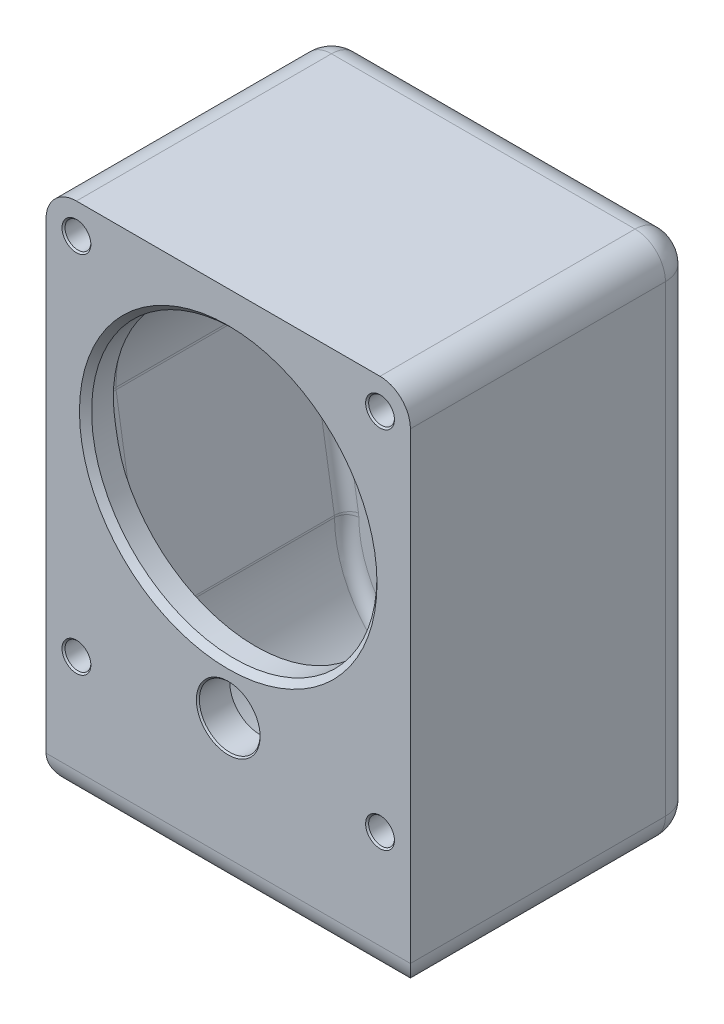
ISO-10303-21;
HEADER;
FILE_DESCRIPTION(('STEP AP214'),'2;1');
FILE_NAME('part.step','',(''),(''),'','','');
FILE_SCHEMA(('AUTOMOTIVE_DESIGN { 1 0 10303 214 1 1 1 1 }'));
ENDSEC;
DATA;
#1=APPLICATION_CONTEXT('core data for automotive mechanical design processes');
#2=APPLICATION_PROTOCOL_DEFINITION('international standard','automotive_design',2000,#1);
#3=PRODUCT_CONTEXT('',#1,'mechanical');
#4=PRODUCT('Part','Part','',(#3));
#5=PRODUCT_RELATED_PRODUCT_CATEGORY('part','',(#4));
#6=PRODUCT_DEFINITION_FORMATION('','',#4);
#7=PRODUCT_DEFINITION_CONTEXT('part definition',#1,'design');
#8=PRODUCT_DEFINITION('design','',#6,#7);
#9=PRODUCT_DEFINITION_SHAPE('','',#8);
#10=(LENGTH_UNIT() NAMED_UNIT(*) SI_UNIT(.MILLI.,.METRE.));
#11=(NAMED_UNIT(*) PLANE_ANGLE_UNIT() SI_UNIT($,.RADIAN.));
#12=(NAMED_UNIT(*) SI_UNIT($,.STERADIAN.) SOLID_ANGLE_UNIT());
#13=UNCERTAINTY_MEASURE_WITH_UNIT(LENGTH_MEASURE(1.E-05),#10,'distance_accuracy_value','');
#14=(GEOMETRIC_REPRESENTATION_CONTEXT(3) GLOBAL_UNCERTAINTY_ASSIGNED_CONTEXT((#13)) GLOBAL_UNIT_ASSIGNED_CONTEXT((#10,
#11,#12)) REPRESENTATION_CONTEXT('',''));
#15=CARTESIAN_POINT('',(0.,0.,0.));
#16=DIRECTION('',(0.,0.,1.));
#17=DIRECTION('',(1.,0.,0.));
#18=AXIS2_PLACEMENT_3D('',#15,#16,#17);
#19=CARTESIAN_POINT('',(60.,-50.,-15.));
#20=DIRECTION('',(0.,0.,-1.));
#21=DIRECTION('',(-1.,0.,0.));
#22=AXIS2_PLACEMENT_3D('',#19,#20,#21);
#23=PLANE('',#22);
#24=CARTESIAN_POINT('',(0.,0.,-15.));
#25=DIRECTION('',(0.,0.,-1.));
#26=DIRECTION('',(-1.,0.,0.));
#27=AXIS2_PLACEMENT_3D('',#24,#25,#26);
#28=CIRCLE('',#27,16.);
#29=CARTESIAN_POINT('',(-16.,0.,-15.));
#30=VERTEX_POINT('',#29);
#31=EDGE_CURVE('E34',#30,#30,#28,.F.);
#32=ORIENTED_EDGE('',*,*,#31,.T.);
#33=EDGE_LOOP('',(#32));
#34=FACE_BOUND('',#33,.T.);
#35=DIRECTION('',(0.,1.,0.));
#36=VECTOR('',#35,1.);
#37=CARTESIAN_POINT('',(-50.,122.5,-15.));
#38=LINE('',#37,#36);
#39=CARTESIAN_POINT('',(-50.,-40.,-15.));
#40=VERTEX_POINT('',#39);
#41=CARTESIAN_POINT('',(-50.,112.5,-15.));
#42=VERTEX_POINT('',#41);
#43=EDGE_CURVE('E41',#40,#42,#38,.T.);
#44=ORIENTED_EDGE('',*,*,#43,.T.);
#45=DIRECTION('',(1.,0.,0.));
#46=VECTOR('',#45,1.);
#47=CARTESIAN_POINT('',(60.,112.5,-15.));
#48=LINE('',#47,#46);
#49=CARTESIAN_POINT('',(50.,112.5,-15.));
#50=VERTEX_POINT('',#49);
#51=EDGE_CURVE('E493',#42,#50,#48,.T.);
#52=ORIENTED_EDGE('',*,*,#51,.T.);
#53=DIRECTION('',(0.,-1.,0.));
#54=VECTOR('',#53,1.);
#55=CARTESIAN_POINT('',(50.,-50.,-15.));
#56=LINE('',#55,#54);
#57=CARTESIAN_POINT('',(50.,-40.,-15.));
#58=VERTEX_POINT('',#57);
#59=EDGE_CURVE('E490',#50,#58,#56,.T.);
#60=ORIENTED_EDGE('',*,*,#59,.T.);
#61=DIRECTION('',(-1.,0.,0.));
#62=VECTOR('',#61,1.);
#63=CARTESIAN_POINT('',(-60.,-40.,-15.));
#64=LINE('',#63,#62);
#65=EDGE_CURVE('E484',#58,#40,#64,.T.);
#66=ORIENTED_EDGE('',*,*,#65,.T.);
#67=EDGE_LOOP('',(#44,#52,#60,#66));
#68=FACE_BOUND('',#67,.T.);
#69=CARTESIAN_POINT('',(0.,62.5,-15.));
#70=DIRECTION('',(0.,0.,-1.));
#71=DIRECTION('',(-1.,0.,0.));
#72=AXIS2_PLACEMENT_3D('',#69,#70,#71);
#73=CIRCLE('',#72,45.);
#74=CARTESIAN_POINT('',(-45.,62.5,-15.));
#75=VERTEX_POINT('',#74);
#76=EDGE_CURVE('E495',#75,#75,#73,.F.);
#77=ORIENTED_EDGE('',*,*,#76,.T.);
#78=EDGE_LOOP('',(#77));
#79=FACE_BOUND('',#78,.T.);
#80=ADVANCED_FACE('F26',(#34,#68,#79),#23,.T.);
#81=CARTESIAN_POINT('',(60.,-50.,0.));
#82=DIRECTION('',(0.,0.,-1.));
#83=DIRECTION('',(-1.,0.,0.));
#84=AXIS2_PLACEMENT_3D('',#81,#82,#83);
#85=PLANE('',#84);
#86=CARTESIAN_POINT('',(43.9987959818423,-0.325502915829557,0.));
#87=DIRECTION('',(0.,0.,-1.));
#88=DIRECTION('',(-1.,0.,0.));
#89=AXIS2_PLACEMENT_3D('',#86,#87,#88);
#90=CIRCLE('',#89,8.);
#91=CARTESIAN_POINT('',(36.0992709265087,0.938421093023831,0.));
#92=VERTEX_POINT('',#91);
#93=CARTESIAN_POINT('',(35.9990148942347,-0.26632056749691,0.));
#94=VERTEX_POINT('',#93);
#95=EDGE_CURVE('E770',#92,#94,#90,.F.);
#96=ORIENTED_EDGE('',*,*,#95,.F.);
#97=DIRECTION('',(0.157990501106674,0.987440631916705,0.));
#98=VECTOR('',#97,1.);
#99=CARTESIAN_POINT('',(28.7491454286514,-44.9998632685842,0.));
#100=LINE('',#99,#98);
#101=CARTESIAN_POINT('',(45.9989460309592,62.8113904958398,0.));
#102=VERTEX_POINT('',#101);
#103=EDGE_CURVE('E758',#92,#102,#100,.T.);
#104=ORIENTED_EDGE('',*,*,#103,.T.);
#105=CARTESIAN_POINT('',(0.,62.5,0.));
#106=DIRECTION('',(0.,0.,-1.));
#107=DIRECTION('',(-1.,0.,0.));
#108=AXIS2_PLACEMENT_3D('',#105,#106,#107);
#109=CIRCLE('',#108,46.);
#110=CARTESIAN_POINT('',(-45.9989460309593,62.81139049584,0.));
#111=VERTEX_POINT('',#110);
#112=EDGE_CURVE('E761',#102,#111,#109,.F.);
#113=ORIENTED_EDGE('',*,*,#112,.T.);
#114=DIRECTION('',(0.157990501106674,-0.987440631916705,0.));
#115=VECTOR('',#114,1.);
#116=CARTESIAN_POINT('',(-25.7538256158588,-63.7206120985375,0.));
#117=LINE('',#116,#115);
#118=CARTESIAN_POINT('',(-36.0992709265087,0.938421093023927,0.));
#119=VERTEX_POINT('',#118);
#120=EDGE_CURVE('E763',#111,#119,#117,.T.);
#121=ORIENTED_EDGE('',*,*,#120,.T.);
#122=CARTESIAN_POINT('',(-43.9987959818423,-0.325502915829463,0.));
#123=DIRECTION('',(0.,0.,-1.));
#124=DIRECTION('',(-1.,0.,0.));
#125=AXIS2_PLACEMENT_3D('',#122,#123,#124);
#126=CIRCLE('',#125,8.);
#127=CARTESIAN_POINT('',(-35.9990148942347,-0.266320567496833,0.));
#128=VERTEX_POINT('',#127);
#129=EDGE_CURVE('E765',#128,#119,#126,.F.);
#130=ORIENTED_EDGE('',*,*,#129,.F.);
#131=CARTESIAN_POINT('',(0.,0.,0.));
#132=DIRECTION('',(0.,0.,-1.));
#133=DIRECTION('',(-1.,0.,0.));
#134=AXIS2_PLACEMENT_3D('',#131,#132,#133);
#135=CIRCLE('',#134,36.);
#136=EDGE_CURVE('E768',#128,#94,#135,.F.);
#137=ORIENTED_EDGE('',*,*,#136,.T.);
#138=EDGE_LOOP('',(#96,#104,#113,#121,#130,#137));
#139=FACE_BOUND('',#138,.T.);
#140=CARTESIAN_POINT('',(0.,0.,0.));
#141=DIRECTION('',(0.,0.,-1.));
#142=DIRECTION('',(-1.,0.,0.));
#143=AXIS2_PLACEMENT_3D('',#140,#141,#142);
#144=CIRCLE('',#143,14.);
#145=CARTESIAN_POINT('',(-14.,0.,0.));
#146=VERTEX_POINT('',#145);
#147=EDGE_CURVE('E798',#146,#146,#144,.T.);
#148=ORIENTED_EDGE('',*,*,#147,.T.);
#149=EDGE_LOOP('',(#148));
#150=FACE_BOUND('',#149,.T.);
#151=CARTESIAN_POINT('',(0.,62.5,0.));
#152=DIRECTION('',(0.,0.,-1.));
#153=DIRECTION('',(-1.,0.,0.));
#154=AXIS2_PLACEMENT_3D('',#151,#152,#153);
#155=CIRCLE('',#154,32.);
#156=CARTESIAN_POINT('',(-32.,62.5,0.));
#157=VERTEX_POINT('',#156);
#158=EDGE_CURVE('E804',#157,#157,#155,.T.);
#159=ORIENTED_EDGE('',*,*,#158,.T.);
#160=EDGE_LOOP('',(#159));
#161=FACE_BOUND('',#160,.T.);
#162=ADVANCED_FACE('F420',(#139,#150,#161),#85,.F.);
#163=CARTESIAN_POINT('',(-60.,-50.,79.));
#164=DIRECTION('',(0.,0.,1.));
#165=DIRECTION('',(1.,0.,0.));
#166=AXIS2_PLACEMENT_3D('',#163,#164,#165);
#167=PLANE('',#166);
#168=CARTESIAN_POINT('',(0.,0.,79.));
#169=DIRECTION('',(0.,0.,1.));
#170=DIRECTION('',(1.,0.,0.));
#171=AXIS2_PLACEMENT_3D('',#168,#169,#170);
#172=CIRCLE('',#171,10.5);
#173=CARTESIAN_POINT('',(10.5,0.,79.));
#174=VERTEX_POINT('',#173);
#175=EDGE_CURVE('E516',#174,#174,#172,.F.);
#176=ORIENTED_EDGE('',*,*,#175,.T.);
#177=EDGE_LOOP('',(#176));
#178=FACE_BOUND('',#177,.T.);
#179=CARTESIAN_POINT('',(-50.,112.5,79.));
#180=DIRECTION('',(0.,0.,1.));
#181=DIRECTION('',(1.,0.,0.));
#182=AXIS2_PLACEMENT_3D('',#179,#180,#181);
#183=CIRCLE('',#182,4.74999999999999);
#184=CARTESIAN_POINT('',(-45.25,112.5,79.));
#185=VERTEX_POINT('',#184);
#186=EDGE_CURVE('E513',#185,#185,#183,.F.);
#187=ORIENTED_EDGE('',*,*,#186,.T.);
#188=EDGE_LOOP('',(#187));
#189=FACE_BOUND('',#188,.T.);
#190=CARTESIAN_POINT('',(50.,112.5,79.));
#191=DIRECTION('',(0.,0.,1.));
#192=DIRECTION('',(1.,0.,0.));
#193=AXIS2_PLACEMENT_3D('',#190,#191,#192);
#194=CIRCLE('',#193,4.74999999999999);
#195=CARTESIAN_POINT('',(54.75,112.5,79.));
#196=VERTEX_POINT('',#195);
#197=EDGE_CURVE('E510',#196,#196,#194,.F.);
#198=ORIENTED_EDGE('',*,*,#197,.T.);
#199=EDGE_LOOP('',(#198));
#200=FACE_BOUND('',#199,.T.);
#201=CARTESIAN_POINT('',(50.,-7.50000000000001,79.));
#202=DIRECTION('',(0.,0.,1.));
#203=DIRECTION('',(1.,0.,0.));
#204=AXIS2_PLACEMENT_3D('',#201,#202,#203);
#205=CIRCLE('',#204,4.74999999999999);
#206=CARTESIAN_POINT('',(54.75,-7.50000000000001,79.));
#207=VERTEX_POINT('',#206);
#208=EDGE_CURVE('E507',#207,#207,#205,.F.);
#209=ORIENTED_EDGE('',*,*,#208,.T.);
#210=EDGE_LOOP('',(#209));
#211=FACE_BOUND('',#210,.T.);
#212=CARTESIAN_POINT('',(-50.,-7.50000000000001,79.));
#213=DIRECTION('',(0.,0.,1.));
#214=DIRECTION('',(1.,0.,0.));
#215=AXIS2_PLACEMENT_3D('',#212,#213,#214);
#216=CIRCLE('',#215,4.74999999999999);
#217=CARTESIAN_POINT('',(-45.25,-7.50000000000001,79.));
#218=VERTEX_POINT('',#217);
#219=EDGE_CURVE('E504',#218,#218,#216,.F.);
#220=ORIENTED_EDGE('',*,*,#219,.T.);
#221=EDGE_LOOP('',(#220));
#222=FACE_BOUND('',#221,.T.);
#223=CARTESIAN_POINT('',(0.,62.9743931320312,79.));
#224=DIRECTION('',(0.,0.,1.));
#225=DIRECTION('',(1.,0.,0.));
#226=AXIS2_PLACEMENT_3D('',#223,#224,#225);
#227=CIRCLE('',#226,49.);
#228=CARTESIAN_POINT('',(49.,62.9743931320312,79.));
#229=VERTEX_POINT('',#228);
#230=EDGE_CURVE('E719',#229,#229,#227,.F.);
#231=ORIENTED_EDGE('',*,*,#230,.T.);
#232=EDGE_LOOP('',(#231));
#233=FACE_BOUND('',#232,.T.);
#234=DIRECTION('',(0.,1.,0.));
#235=VECTOR('',#234,1.);
#236=CARTESIAN_POINT('',(60.,122.5,79.));
#237=LINE('',#236,#235);
#238=CARTESIAN_POINT('',(60.,-40.,79.));
#239=VERTEX_POINT('',#238);
#240=CARTESIAN_POINT('',(60.,112.5,79.));
#241=VERTEX_POINT('',#240);
#242=EDGE_CURVE('E810',#239,#241,#237,.T.);
#243=ORIENTED_EDGE('',*,*,#242,.T.);
#244=CARTESIAN_POINT('',(50.,112.5,79.));
#245=DIRECTION('',(0.,0.,1.));
#246=DIRECTION('',(1.,0.,0.));
#247=AXIS2_PLACEMENT_3D('',#244,#245,#246);
#248=CIRCLE('',#247,10.);
#249=CARTESIAN_POINT('',(50.,122.5,79.));
#250=VERTEX_POINT('',#249);
#251=EDGE_CURVE('E700',#241,#250,#248,.T.);
#252=ORIENTED_EDGE('',*,*,#251,.T.);
#253=DIRECTION('',(-1.,0.,0.));
#254=VECTOR('',#253,1.);
#255=CARTESIAN_POINT('',(-60.,122.5,79.));
#256=LINE('',#255,#254);
#257=CARTESIAN_POINT('',(-50.,122.5,79.));
#258=VERTEX_POINT('',#257);
#259=EDGE_CURVE('E807',#250,#258,#256,.T.);
#260=ORIENTED_EDGE('',*,*,#259,.T.);
#261=CARTESIAN_POINT('',(-50.,112.5,79.));
#262=DIRECTION('',(0.,0.,1.));
#263=DIRECTION('',(1.,0.,0.));
#264=AXIS2_PLACEMENT_3D('',#261,#262,#263);
#265=CIRCLE('',#264,10.);
#266=CARTESIAN_POINT('',(-60.,112.5,79.));
#267=VERTEX_POINT('',#266);
#268=EDGE_CURVE('E702',#258,#267,#265,.T.);
#269=ORIENTED_EDGE('',*,*,#268,.T.);
#270=DIRECTION('',(0.,-1.,0.));
#271=VECTOR('',#270,1.);
#272=CARTESIAN_POINT('',(-60.,122.5,79.));
#273=LINE('',#272,#271);
#274=CARTESIAN_POINT('',(-60.,-40.,79.));
#275=VERTEX_POINT('',#274);
#276=EDGE_CURVE('E813',#267,#275,#273,.T.);
#277=ORIENTED_EDGE('',*,*,#276,.T.);
#278=DIRECTION('',(1.,0.,0.));
#279=VECTOR('',#278,1.);
#280=CARTESIAN_POINT('',(60.,-40.,79.));
#281=LINE('',#280,#279);
#282=EDGE_CURVE('E704',#275,#239,#281,.T.);
#283=ORIENTED_EDGE('',*,*,#282,.T.);
#284=EDGE_LOOP('',(#243,#252,#260,#269,#277,#283));
#285=FACE_BOUND('',#284,.T.);
#286=ADVANCED_FACE('F423',(#178,#189,#200,#211,#222,#233,#285),#167,.T.);
#287=CARTESIAN_POINT('',(-60.,122.5,70.));
#288=DIRECTION('',(0.,-1.,0.));
#289=DIRECTION('',(0.,0.,-1.));
#290=AXIS2_PLACEMENT_3D('',#287,#288,#289);
#291=PLANE('',#290);
#292=ORIENTED_EDGE('',*,*,#259,.F.);
#293=DIRECTION('',(0.,0.,-1.));
#294=VECTOR('',#293,1.);
#295=CARTESIAN_POINT('',(50.,122.5,70.));
#296=LINE('',#295,#294);
#297=CARTESIAN_POINT('',(50.,122.5,-5.));
#298=VERTEX_POINT('',#297);
#299=EDGE_CURVE('E712',#250,#298,#296,.T.);
#300=ORIENTED_EDGE('',*,*,#299,.T.);
#301=DIRECTION('',(1.,0.,0.));
#302=VECTOR('',#301,1.);
#303=CARTESIAN_POINT('',(-60.,122.5,-5.));
#304=LINE('',#303,#302);
#305=CARTESIAN_POINT('',(-50.,122.5,-5.));
#306=VERTEX_POINT('',#305);
#307=EDGE_CURVE('E717',#298,#306,#304,.F.);
#308=ORIENTED_EDGE('',*,*,#307,.T.);
#309=DIRECTION('',(0.,0.,-1.));
#310=VECTOR('',#309,1.);
#311=CARTESIAN_POINT('',(-50.,122.5,70.));
#312=LINE('',#311,#310);
#313=EDGE_CURVE('E715',#306,#258,#312,.F.);
#314=ORIENTED_EDGE('',*,*,#313,.T.);
#315=EDGE_LOOP('',(#292,#300,#308,#314));
#316=FACE_BOUND('',#315,.T.);
#317=ADVANCED_FACE('F442',(#316),#291,.F.);
#318=CARTESIAN_POINT('',(60.,122.5,70.));
#319=DIRECTION('',(-1.,0.,0.));
#320=DIRECTION('',(0.,-1.,0.));
#321=AXIS2_PLACEMENT_3D('',#318,#319,#320);
#322=PLANE('',#321);
#323=DIRECTION('',(0.,-1.,0.));
#324=VECTOR('',#323,1.);
#325=CARTESIAN_POINT('',(60.,122.5,-5.));
#326=LINE('',#325,#324);
#327=CARTESIAN_POINT('',(60.,-40.,-5.));
#328=VERTEX_POINT('',#327);
#329=CARTESIAN_POINT('',(60.,112.5,-5.));
#330=VERTEX_POINT('',#329);
#331=EDGE_CURVE('E710',#328,#330,#326,.F.);
#332=ORIENTED_EDGE('',*,*,#331,.T.);
#333=DIRECTION('',(0.,0.,-1.));
#334=VECTOR('',#333,1.);
#335=CARTESIAN_POINT('',(60.,112.5,70.));
#336=LINE('',#335,#334);
#337=EDGE_CURVE('E706',#330,#241,#336,.F.);
#338=ORIENTED_EDGE('',*,*,#337,.T.);
#339=ORIENTED_EDGE('',*,*,#242,.F.);
#340=DIRECTION('',(0.,0.,-1.));
#341=VECTOR('',#340,1.);
#342=CARTESIAN_POINT('',(60.,-40.,70.));
#343=LINE('',#342,#341);
#344=EDGE_CURVE('E708',#239,#328,#343,.T.);
#345=ORIENTED_EDGE('',*,*,#344,.T.);
#346=EDGE_LOOP('',(#332,#338,#339,#345));
#347=FACE_BOUND('',#346,.T.);
#348=ADVANCED_FACE('F460',(#347),#322,.F.);
#349=CARTESIAN_POINT('',(-60.,-50.,70.));
#350=DIRECTION('',(0.,1.,0.));
#351=DIRECTION('',(-1.,0.,0.));
#352=AXIS2_PLACEMENT_3D('',#349,#350,#351);
#353=PLANE('',#352);
#354=DIRECTION('',(0.,0.,-1.));
#355=VECTOR('',#354,1.);
#356=CARTESIAN_POINT('',(50.,-50.,70.));
#357=LINE('',#356,#355);
#358=CARTESIAN_POINT('',(50.,-50.,-5.));
#359=VERTEX_POINT('',#358);
#360=CARTESIAN_POINT('',(50.,-50.,69.));
#361=VERTEX_POINT('',#360);
#362=EDGE_CURVE('E473',#359,#361,#357,.F.);
#363=ORIENTED_EDGE('',*,*,#362,.T.);
#364=DIRECTION('',(1.,0.,0.));
#365=VECTOR('',#364,1.);
#366=CARTESIAN_POINT('',(-60.,-50.,69.));
#367=LINE('',#366,#365);
#368=CARTESIAN_POINT('',(-50.,-50.,69.));
#369=VERTEX_POINT('',#368);
#370=EDGE_CURVE('E475',#361,#369,#367,.F.);
#371=ORIENTED_EDGE('',*,*,#370,.T.);
#372=DIRECTION('',(0.,0.,-1.));
#373=VECTOR('',#372,1.);
#374=CARTESIAN_POINT('',(-50.,-50.,70.));
#375=LINE('',#374,#373);
#376=CARTESIAN_POINT('',(-50.,-50.,-5.));
#377=VERTEX_POINT('',#376);
#378=EDGE_CURVE('E482',#369,#377,#375,.T.);
#379=ORIENTED_EDGE('',*,*,#378,.T.);
#380=DIRECTION('',(-1.,0.,0.));
#381=VECTOR('',#380,1.);
#382=CARTESIAN_POINT('',(60.,-50.,-5.));
#383=LINE('',#382,#381);
#384=EDGE_CURVE('E478',#377,#359,#383,.F.);
#385=ORIENTED_EDGE('',*,*,#384,.T.);
#386=EDGE_LOOP('',(#363,#371,#379,#385));
#387=FACE_BOUND('',#386,.T.);
#388=ADVANCED_FACE('F463',(#387),#353,.F.);
#389=CARTESIAN_POINT('',(-60.,122.5,70.));
#390=DIRECTION('',(1.,0.,0.));
#391=DIRECTION('',(0.,1.,0.));
#392=AXIS2_PLACEMENT_3D('',#389,#390,#391);
#393=PLANE('',#392);
#394=ORIENTED_EDGE('',*,*,#276,.F.);
#395=DIRECTION('',(0.,0.,-1.));
#396=VECTOR('',#395,1.);
#397=CARTESIAN_POINT('',(-60.,112.5,70.));
#398=LINE('',#397,#396);
#399=CARTESIAN_POINT('',(-60.,112.5,-5.));
#400=VERTEX_POINT('',#399);
#401=EDGE_CURVE('E694',#267,#400,#398,.T.);
#402=ORIENTED_EDGE('',*,*,#401,.T.);
#403=DIRECTION('',(0.,1.,0.));
#404=VECTOR('',#403,1.);
#405=CARTESIAN_POINT('',(-60.,-50.,-5.));
#406=LINE('',#405,#404);
#407=CARTESIAN_POINT('',(-60.,-40.,-5.));
#408=VERTEX_POINT('',#407);
#409=EDGE_CURVE('E698',#400,#408,#406,.F.);
#410=ORIENTED_EDGE('',*,*,#409,.T.);
#411=DIRECTION('',(0.,0.,-1.));
#412=VECTOR('',#411,1.);
#413=CARTESIAN_POINT('',(-60.,-40.,70.));
#414=LINE('',#413,#412);
#415=EDGE_CURVE('E691',#408,#275,#414,.F.);
#416=ORIENTED_EDGE('',*,*,#415,.T.);
#417=EDGE_LOOP('',(#394,#402,#410,#416));
#418=FACE_BOUND('',#417,.T.);
#419=ADVANCED_FACE('F28',(#418),#393,.F.);
#420=CARTESIAN_POINT('',(0.,62.5,-25.));
#421=DIRECTION('',(0.,0.,-1.));
#422=DIRECTION('',(-1.,0.,0.));
#423=AXIS2_PLACEMENT_3D('',#420,#421,#422);
#424=PLANE('',#423);
#425=CARTESIAN_POINT('',(0.,62.5,-25.));
#426=DIRECTION('',(0.,0.,-1.));
#427=DIRECTION('',(-1.,0.,0.));
#428=AXIS2_PLACEMENT_3D('',#425,#426,#427);
#429=CIRCLE('',#428,35.);
#430=CARTESIAN_POINT('',(-35.,62.5,-25.));
#431=VERTEX_POINT('',#430);
#432=EDGE_CURVE('E498',#431,#431,#429,.T.);
#433=ORIENTED_EDGE('',*,*,#432,.T.);
#434=EDGE_LOOP('',(#433));
#435=FACE_BOUND('',#434,.T.);
#436=CARTESIAN_POINT('',(0.,62.5,-25.));
#437=DIRECTION('',(0.,0.,-1.));
#438=DIRECTION('',(-1.,0.,0.));
#439=AXIS2_PLACEMENT_3D('',#436,#437,#438);
#440=CIRCLE('',#439,13.);
#441=CARTESIAN_POINT('',(-13.,62.5,-25.));
#442=VERTEX_POINT('',#441);
#443=EDGE_CURVE('E822',#442,#442,#440,.T.);
#444=ORIENTED_EDGE('',*,*,#443,.F.);
#445=EDGE_LOOP('',(#444));
#446=FACE_BOUND('',#445,.T.);
#447=ADVANCED_FACE('F415',(#435,#446),#424,.T.);
#448=CARTESIAN_POINT('',(0.,62.5,-18.));
#449=DIRECTION('',(0.,0.,-1.));
#450=DIRECTION('',(-1.,0.,0.));
#451=AXIS2_PLACEMENT_3D('',#448,#449,#450);
#452=CYLINDRICAL_SURFACE('',#451,13.);
#453=CARTESIAN_POINT('',(0.,62.5,-18.));
#454=DIRECTION('',(0.,0.,1.));
#455=DIRECTION('',(1.,0.,0.));
#456=AXIS2_PLACEMENT_3D('',#453,#454,#455);
#457=CIRCLE('',#456,13.);
#458=CARTESIAN_POINT('',(13.,62.5,-18.));
#459=VERTEX_POINT('',#458);
#460=EDGE_CURVE('E1403',#459,#459,#457,.F.);
#461=ORIENTED_EDGE('',*,*,#460,.F.);
#462=EDGE_LOOP('',(#461));
#463=FACE_BOUND('',#462,.T.);
#464=ORIENTED_EDGE('',*,*,#443,.T.);
#465=EDGE_LOOP('',(#464));
#466=FACE_BOUND('',#465,.T.);
#467=ADVANCED_FACE('F411',(#463,#466),#452,.F.);
#468=CARTESIAN_POINT('',(0.,62.5,79.));
#469=DIRECTION('',(0.,0.,-1.));
#470=DIRECTION('',(-1.,0.,0.));
#471=AXIS2_PLACEMENT_3D('',#468,#469,#470);
#472=CYLINDRICAL_SURFACE('',#471,30.);
#473=CARTESIAN_POINT('',(0.,62.5,-9.99999999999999));
#474=DIRECTION('',(0.,0.,1.));
#475=DIRECTION('',(1.,0.,0.));
#476=AXIS2_PLACEMENT_3D('',#473,#474,#475);
#477=CIRCLE('',#476,30.);
#478=CARTESIAN_POINT('',(30.,62.5,-9.99999999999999));
#479=VERTEX_POINT('',#478);
#480=EDGE_CURVE('E223',#479,#479,#477,.F.);
#481=ORIENTED_EDGE('',*,*,#480,.T.);
#482=EDGE_LOOP('',(#481));
#483=FACE_BOUND('',#482,.T.);
#484=CARTESIAN_POINT('',(0.,62.5,-2.00000000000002));
#485=DIRECTION('',(0.,0.,-1.));
#486=DIRECTION('',(-1.,0.,0.));
#487=AXIS2_PLACEMENT_3D('',#484,#485,#486);
#488=CIRCLE('',#487,30.);
#489=CARTESIAN_POINT('',(-30.,62.5,-2.00000000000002));
#490=VERTEX_POINT('',#489);
#491=EDGE_CURVE('E801',#490,#490,#488,.F.);
#492=ORIENTED_EDGE('',*,*,#491,.T.);
#493=EDGE_LOOP('',(#492));
#494=FACE_BOUND('',#493,.T.);
#495=ADVANCED_FACE('F407',(#483,#494),#472,.F.);
#496=CARTESIAN_POINT('',(-60.,-50.,70.));
#497=DIRECTION('',(0.,0.,1.));
#498=DIRECTION('',(1.,0.,0.));
#499=AXIS2_PLACEMENT_3D('',#496,#497,#498);
#500=PLANE('',#499);
#501=DIRECTION('',(0.157990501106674,-0.987440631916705,0.));
#502=VECTOR('',#501,1.);
#503=CARTESIAN_POINT('',(-28.7491454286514,-44.9998632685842,70.));
#504=LINE('',#503,#502);
#505=CARTESIAN_POINT('',(-36.0992709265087,0.938421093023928,70.));
#506=VERTEX_POINT('',#505);
#507=CARTESIAN_POINT('',(-42.9831300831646,43.9625408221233,70.));
#508=VERTEX_POINT('',#507);
#509=EDGE_CURVE('E778',#506,#508,#504,.F.);
#510=ORIENTED_EDGE('',*,*,#509,.T.);
#511=CARTESIAN_POINT('',(0.,62.9743931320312,70.));
#512=DIRECTION('',(0.,0.,1.));
#513=DIRECTION('',(1.,0.,0.));
#514=AXIS2_PLACEMENT_3D('',#511,#512,#513);
#515=CIRCLE('',#514,47.);
#516=CARTESIAN_POINT('',(42.9831300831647,43.9625408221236,70.));
#517=VERTEX_POINT('',#516);
#518=EDGE_CURVE('E895',#508,#517,#515,.T.);
#519=ORIENTED_EDGE('',*,*,#518,.T.);
#520=DIRECTION('',(0.157990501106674,0.987440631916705,0.));
#521=VECTOR('',#520,1.);
#522=CARTESIAN_POINT('',(25.7538256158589,-63.7206120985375,70.));
#523=LINE('',#522,#521);
#524=CARTESIAN_POINT('',(36.0992709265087,0.938421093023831,70.));
#525=VERTEX_POINT('',#524);
#526=EDGE_CURVE('E773',#517,#525,#523,.F.);
#527=ORIENTED_EDGE('',*,*,#526,.T.);
#528=CARTESIAN_POINT('',(43.9987959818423,-0.325502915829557,70.));
#529=DIRECTION('',(0.,0.,1.));
#530=DIRECTION('',(1.,0.,0.));
#531=AXIS2_PLACEMENT_3D('',#528,#529,#530);
#532=CIRCLE('',#531,8.);
#533=CARTESIAN_POINT('',(35.9990148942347,-0.26632056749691,70.));
#534=VERTEX_POINT('',#533);
#535=EDGE_CURVE('E775',#534,#525,#532,.F.);
#536=ORIENTED_EDGE('',*,*,#535,.F.);
#537=CARTESIAN_POINT('',(0.,0.,70.));
#538=DIRECTION('',(0.,0.,1.));
#539=DIRECTION('',(1.,0.,0.));
#540=AXIS2_PLACEMENT_3D('',#537,#538,#539);
#541=CIRCLE('',#540,36.);
#542=CARTESIAN_POINT('',(-35.9990148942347,-0.266320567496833,70.));
#543=VERTEX_POINT('',#542);
#544=EDGE_CURVE('E781',#534,#543,#541,.F.);
#545=ORIENTED_EDGE('',*,*,#544,.T.);
#546=CARTESIAN_POINT('',(-43.9987959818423,-0.325502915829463,70.));
#547=DIRECTION('',(0.,0.,1.));
#548=DIRECTION('',(1.,0.,0.));
#549=AXIS2_PLACEMENT_3D('',#546,#547,#548);
#550=CIRCLE('',#549,8.);
#551=EDGE_CURVE('E783',#506,#543,#550,.F.);
#552=ORIENTED_EDGE('',*,*,#551,.F.);
#553=EDGE_LOOP('',(#510,#519,#527,#536,#545,#552));
#554=FACE_BOUND('',#553,.T.);
#555=CARTESIAN_POINT('',(0.,0.,70.));
#556=DIRECTION('',(0.,0.,1.));
#557=DIRECTION('',(1.,0.,0.));
#558=AXIS2_PLACEMENT_3D('',#555,#556,#557);
#559=CIRCLE('',#558,14.);
#560=CARTESIAN_POINT('',(14.,0.,70.));
#561=VERTEX_POINT('',#560);
#562=EDGE_CURVE('E795',#561,#561,#559,.T.);
#563=ORIENTED_EDGE('',*,*,#562,.T.);
#564=EDGE_LOOP('',(#563));
#565=FACE_BOUND('',#564,.T.);
#566=ADVANCED_FACE('F410',(#554,#565),#500,.F.);
#567=CARTESIAN_POINT('',(0.,0.,70.));
#568=DIRECTION('',(0.,0.,-1.));
#569=DIRECTION('',(-1.,0.,0.));
#570=AXIS2_PLACEMENT_3D('',#567,#568,#569);
#571=CYLINDRICAL_SURFACE('',#570,40.);
#572=CARTESIAN_POINT('',(0.,0.,66.));
#573=DIRECTION('',(0.,0.,1.));
#574=DIRECTION('',(1.,0.,0.));
#575=AXIS2_PLACEMENT_3D('',#572,#573,#574);
#576=CIRCLE('',#575,40.);
#577=CARTESIAN_POINT('',(-39.9989054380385,-0.295911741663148,66.));
#578=VERTEX_POINT('',#577);
#579=CARTESIAN_POINT('',(39.9989054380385,-0.295911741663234,66.));
#580=VERTEX_POINT('',#579);
#581=EDGE_CURVE('E730',#578,#580,#576,.T.);
#582=ORIENTED_EDGE('',*,*,#581,.T.);
#583=DIRECTION('',(0.,0.,-1.));
#584=VECTOR('',#583,1.);
#585=CARTESIAN_POINT('',(39.9989054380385,-0.295911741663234,70.));
#586=LINE('',#585,#584);
#587=CARTESIAN_POINT('',(39.9989054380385,-0.295911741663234,4.));
#588=VERTEX_POINT('',#587);
#589=EDGE_CURVE('E725',#580,#588,#586,.T.);
#590=ORIENTED_EDGE('',*,*,#589,.T.);
#591=CARTESIAN_POINT('',(0.,0.,4.));
#592=DIRECTION('',(0.,0.,-1.));
#593=DIRECTION('',(-1.,0.,0.));
#594=AXIS2_PLACEMENT_3D('',#591,#592,#593);
#595=CIRCLE('',#594,40.);
#596=CARTESIAN_POINT('',(-39.9989054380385,-0.295911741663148,4.));
#597=VERTEX_POINT('',#596);
#598=EDGE_CURVE('E736',#588,#597,#595,.T.);
#599=ORIENTED_EDGE('',*,*,#598,.T.);
#600=DIRECTION('',(0.,0.,-1.));
#601=VECTOR('',#600,1.);
#602=CARTESIAN_POINT('',(-39.9989054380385,-0.295911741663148,70.));
#603=LINE('',#602,#601);
#604=EDGE_CURVE('E732',#597,#578,#603,.F.);
#605=ORIENTED_EDGE('',*,*,#604,.T.);
#606=EDGE_LOOP('',(#582,#590,#599,#605));
#607=FACE_BOUND('',#606,.T.);
#608=ADVANCED_FACE('F438',(#607),#571,.F.);
#609=CARTESIAN_POINT('',(50.,62.4999999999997,70.));
#610=DIRECTION('',(-0.987440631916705,0.157990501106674,0.));
#611=DIRECTION('',(-0.157990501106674,-0.987440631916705,0.));
#612=AXIS2_PLACEMENT_3D('',#609,#610,#611);
#613=PLANE('',#612);
#614=DIRECTION('',(0.157990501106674,0.987440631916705,0.));
#615=VECTOR('',#614,1.);
#616=CARTESIAN_POINT('',(50.,62.4999999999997,66.));
#617=LINE('',#616,#615);
#618=CARTESIAN_POINT('',(40.0490334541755,0.306459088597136,66.));
#619=VERTEX_POINT('',#618);
#620=CARTESIAN_POINT('',(49.9487085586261,62.1794284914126,66.));
#621=VERTEX_POINT('',#620);
#622=EDGE_CURVE('E788',#619,#621,#617,.T.);
#623=ORIENTED_EDGE('',*,*,#622,.T.);
#624=DIRECTION('',(0.,0.,1.));
#625=VECTOR('',#624,1.);
#626=CARTESIAN_POINT('',(49.9487085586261,62.1794284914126,0.));
#627=LINE('',#626,#625);
#628=CARTESIAN_POINT('',(49.9487085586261,62.1794284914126,4.));
#629=VERTEX_POINT('',#628);
#630=EDGE_CURVE('E786',#621,#629,#627,.F.);
#631=ORIENTED_EDGE('',*,*,#630,.T.);
#632=DIRECTION('',(0.157990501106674,0.987440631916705,0.));
#633=VECTOR('',#632,1.);
#634=CARTESIAN_POINT('',(50.,62.4999999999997,4.));
#635=LINE('',#634,#633);
#636=CARTESIAN_POINT('',(40.0490334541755,0.306459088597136,4.));
#637=VERTEX_POINT('',#636);
#638=EDGE_CURVE('E791',#629,#637,#635,.F.);
#639=ORIENTED_EDGE('',*,*,#638,.T.);
#640=DIRECTION('',(0.,0.,-1.));
#641=VECTOR('',#640,1.);
#642=CARTESIAN_POINT('',(40.0490334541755,0.306459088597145,70.));
#643=LINE('',#642,#641);
#644=EDGE_CURVE('E793',#637,#619,#643,.F.);
#645=ORIENTED_EDGE('',*,*,#644,.T.);
#646=EDGE_LOOP('',(#623,#631,#639,#645));
#647=FACE_BOUND('',#646,.T.);
#648=ADVANCED_FACE('F450',(#647),#613,.T.);
#649=CARTESIAN_POINT('',(0.,62.5,70.));
#650=DIRECTION('',(0.,0.,-1.));
#651=DIRECTION('',(-1.,0.,0.));
#652=AXIS2_PLACEMENT_3D('',#649,#650,#651);
#653=CYLINDRICAL_SURFACE('',#652,50.);
#654=DIRECTION('',(0.,0.,-1.));
#655=VECTOR('',#654,1.);
#656=CARTESIAN_POINT('',(49.9988543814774,62.8384679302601,70.));
#657=LINE('',#656,#655);
#658=CARTESIAN_POINT('',(49.9988543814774,62.8384679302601,4.));
#659=VERTEX_POINT('',#658);
#660=CARTESIAN_POINT('',(49.9988543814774,62.8384679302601,66.));
#661=VERTEX_POINT('',#660);
#662=EDGE_CURVE('E751',#659,#661,#657,.F.);
#663=ORIENTED_EDGE('',*,*,#662,.T.);
#664=CARTESIAN_POINT('',(0.,62.5,66.));
#665=DIRECTION('',(0.,0.,1.));
#666=DIRECTION('',(1.,0.,0.));
#667=AXIS2_PLACEMENT_3D('',#664,#665,#666);
#668=CIRCLE('',#667,50.);
#669=CARTESIAN_POINT('',(-49.9988543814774,62.8384679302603,66.));
#670=VERTEX_POINT('',#669);
#671=EDGE_CURVE('E748',#661,#670,#668,.T.);
#672=ORIENTED_EDGE('',*,*,#671,.T.);
#673=DIRECTION('',(0.,0.,-1.));
#674=VECTOR('',#673,1.);
#675=CARTESIAN_POINT('',(-49.9988543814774,62.8384679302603,70.));
#676=LINE('',#675,#674);
#677=CARTESIAN_POINT('',(-49.9988543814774,62.8384679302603,4.));
#678=VERTEX_POINT('',#677);
#679=EDGE_CURVE('E756',#670,#678,#676,.T.);
#680=ORIENTED_EDGE('',*,*,#679,.T.);
#681=CARTESIAN_POINT('',(0.,62.5,4.));
#682=DIRECTION('',(0.,0.,-1.));
#683=DIRECTION('',(-1.,0.,0.));
#684=AXIS2_PLACEMENT_3D('',#681,#682,#683);
#685=CIRCLE('',#684,50.);
#686=EDGE_CURVE('E754',#678,#659,#685,.T.);
#687=ORIENTED_EDGE('',*,*,#686,.T.);
#688=EDGE_LOOP('',(#663,#672,#680,#687));
#689=FACE_BOUND('',#688,.T.);
#690=ADVANCED_FACE('F446',(#689),#653,.F.);
#691=CARTESIAN_POINT('',(-50.,62.5,70.));
#692=DIRECTION('',(0.987440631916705,0.157990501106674,0.));
#693=DIRECTION('',(-0.157990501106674,0.987440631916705,0.));
#694=AXIS2_PLACEMENT_3D('',#691,#692,#693);
#695=PLANE('',#694);
#696=DIRECTION('',(0.,0.,1.));
#697=VECTOR('',#696,1.);
#698=CARTESIAN_POINT('',(-49.9487085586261,62.1794284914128,70.));
#699=LINE('',#698,#697);
#700=CARTESIAN_POINT('',(-49.9487085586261,62.1794284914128,4.));
#701=VERTEX_POINT('',#700);
#702=CARTESIAN_POINT('',(-49.9487085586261,62.1794284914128,66.));
#703=VERTEX_POINT('',#702);
#704=EDGE_CURVE('E741',#701,#703,#699,.T.);
#705=ORIENTED_EDGE('',*,*,#704,.T.);
#706=DIRECTION('',(0.157990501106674,-0.987440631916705,0.));
#707=VECTOR('',#706,1.);
#708=CARTESIAN_POINT('',(-50.,62.5,66.));
#709=LINE('',#708,#707);
#710=CARTESIAN_POINT('',(-40.0490334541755,0.306459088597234,66.));
#711=VERTEX_POINT('',#710);
#712=EDGE_CURVE('E738',#703,#711,#709,.T.);
#713=ORIENTED_EDGE('',*,*,#712,.T.);
#714=DIRECTION('',(0.,0.,-1.));
#715=VECTOR('',#714,1.);
#716=CARTESIAN_POINT('',(-40.0490334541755,0.306459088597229,70.));
#717=LINE('',#716,#715);
#718=CARTESIAN_POINT('',(-40.0490334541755,0.306459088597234,4.));
#719=VERTEX_POINT('',#718);
#720=EDGE_CURVE('E746',#711,#719,#717,.T.);
#721=ORIENTED_EDGE('',*,*,#720,.T.);
#722=DIRECTION('',(0.157990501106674,-0.987440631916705,0.));
#723=VECTOR('',#722,1.);
#724=CARTESIAN_POINT('',(-50.,62.5,4.));
#725=LINE('',#724,#723);
#726=EDGE_CURVE('E744',#719,#701,#725,.F.);
#727=ORIENTED_EDGE('',*,*,#726,.T.);
#728=EDGE_LOOP('',(#705,#713,#721,#727));
#729=FACE_BOUND('',#728,.T.);
#730=ADVANCED_FACE('F434',(#729),#695,.T.);
#731=CARTESIAN_POINT('',(0.,0.,68.5));
#732=DIRECTION('',(0.,0.,-1.));
#733=DIRECTION('',(-1.,0.,0.));
#734=AXIS2_PLACEMENT_3D('',#731,#732,#733);
#735=PLANE('',#734);
#736=CARTESIAN_POINT('',(0.,0.,68.5));
#737=DIRECTION('',(0.,0.,-1.));
#738=DIRECTION('',(-1.,0.,0.));
#739=AXIS2_PLACEMENT_3D('',#736,#737,#738);
#740=CIRCLE('',#739,12.5);
#741=CARTESIAN_POINT('',(-12.5,0.,68.5));
#742=VERTEX_POINT('',#741);
#743=EDGE_CURVE('E816',#742,#742,#740,.T.);
#744=ORIENTED_EDGE('',*,*,#743,.T.);
#745=EDGE_LOOP('',(#744));
#746=FACE_BOUND('',#745,.T.);
#747=CARTESIAN_POINT('',(0.,0.,68.5));
#748=DIRECTION('',(0.,0.,-1.));
#749=DIRECTION('',(-1.,0.,0.));
#750=AXIS2_PLACEMENT_3D('',#747,#748,#749);
#751=CIRCLE('',#750,10.);
#752=CARTESIAN_POINT('',(-10.,0.,68.5));
#753=VERTEX_POINT('',#752);
#754=EDGE_CURVE('E819',#753,#753,#751,.T.);
#755=ORIENTED_EDGE('',*,*,#754,.F.);
#756=EDGE_LOOP('',(#755));
#757=FACE_BOUND('',#756,.T.);
#758=ADVANCED_FACE('F430',(#746,#757),#735,.T.);
#759=CARTESIAN_POINT('',(0.,0.,68.5));
#760=DIRECTION('',(0.,0.,1.));
#761=DIRECTION('',(1.,0.,0.));
#762=AXIS2_PLACEMENT_3D('',#759,#760,#761);
#763=CYLINDRICAL_SURFACE('',#762,10.);
#764=CARTESIAN_POINT('',(0.,0.,78.5));
#765=DIRECTION('',(0.,0.,1.));
#766=DIRECTION('',(1.,0.,0.));
#767=AXIS2_PLACEMENT_3D('',#764,#765,#766);
#768=CIRCLE('',#767,10.);
#769=CARTESIAN_POINT('',(10.,0.,78.5));
#770=VERTEX_POINT('',#769);
#771=EDGE_CURVE('E501',#770,#770,#768,.T.);
#772=ORIENTED_EDGE('',*,*,#771,.T.);
#773=EDGE_LOOP('',(#772));
#774=FACE_BOUND('',#773,.T.);
#775=ORIENTED_EDGE('',*,*,#754,.T.);
#776=EDGE_LOOP('',(#775));
#777=FACE_BOUND('',#776,.T.);
#778=ADVANCED_FACE('F405',(#774,#777),#763,.F.);
#779=CARTESIAN_POINT('',(0.,62.5,0.));
#780=DIRECTION('',(0.,0.,1.));
#781=DIRECTION('',(1.,0.,0.));
#782=AXIS2_PLACEMENT_3D('',#779,#780,#781);
#783=CONICAL_SURFACE('',#782,32.,0.785398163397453);
#784=ORIENTED_EDGE('',*,*,#491,.F.);
#785=EDGE_LOOP('',(#784));
#786=FACE_BOUND('',#785,.T.);
#787=ORIENTED_EDGE('',*,*,#158,.F.);
#788=EDGE_LOOP('',(#787));
#789=FACE_BOUND('',#788,.T.);
#790=ADVANCED_FACE('F401',(#786,#789),#783,.F.);
#791=CARTESIAN_POINT('',(0.,0.,-25.));
#792=DIRECTION('',(0.,0.,1.));
#793=DIRECTION('',(1.,0.,0.));
#794=AXIS2_PLACEMENT_3D('',#791,#792,#793);
#795=CYLINDRICAL_SURFACE('',#794,10.);
#796=CARTESIAN_POINT('',(0.,0.,-15.));
#797=DIRECTION('',(0.,0.,-1.));
#798=DIRECTION('',(-1.,0.,0.));
#799=AXIS2_PLACEMENT_3D('',#796,#797,#798);
#800=CIRCLE('',#799,10.);
#801=CARTESIAN_POINT('',(-10.,0.,-15.));
#802=VERTEX_POINT('',#801);
#803=EDGE_CURVE('E1414',#802,#802,#800,.F.);
#804=ORIENTED_EDGE('',*,*,#803,.F.);
#805=EDGE_LOOP('',(#804));
#806=FACE_BOUND('',#805,.T.);
#807=CARTESIAN_POINT('',(0.,0.,1.5));
#808=DIRECTION('',(0.,0.,1.));
#809=DIRECTION('',(1.,0.,0.));
#810=AXIS2_PLACEMENT_3D('',#807,#808,#809);
#811=CIRCLE('',#810,10.);
#812=CARTESIAN_POINT('',(10.,0.,1.5));
#813=VERTEX_POINT('',#812);
#814=EDGE_CURVE('E828',#813,#813,#811,.T.);
#815=ORIENTED_EDGE('',*,*,#814,.T.);
#816=EDGE_LOOP('',(#815));
#817=FACE_BOUND('',#816,.T.);
#818=ADVANCED_FACE('F397',(#806,#817),#795,.F.);
#819=CARTESIAN_POINT('',(0.,0.,1.5));
#820=DIRECTION('',(0.,0.,1.));
#821=DIRECTION('',(1.,0.,0.));
#822=AXIS2_PLACEMENT_3D('',#819,#820,#821);
#823=PLANE('',#822);
#824=CARTESIAN_POINT('',(0.,0.,1.5));
#825=DIRECTION('',(0.,0.,1.));
#826=DIRECTION('',(1.,0.,0.));
#827=AXIS2_PLACEMENT_3D('',#824,#825,#826);
#828=CIRCLE('',#827,12.5);
#829=CARTESIAN_POINT('',(12.5,0.,1.5));
#830=VERTEX_POINT('',#829);
#831=EDGE_CURVE('E825',#830,#830,#828,.T.);
#832=ORIENTED_EDGE('',*,*,#831,.T.);
#833=EDGE_LOOP('',(#832));
#834=FACE_BOUND('',#833,.T.);
#835=ORIENTED_EDGE('',*,*,#814,.F.);
#836=EDGE_LOOP('',(#835));
#837=FACE_BOUND('',#836,.T.);
#838=ADVANCED_FACE('F393',(#834,#837),#823,.T.);
#839=CARTESIAN_POINT('',(0.,0.,1.5));
#840=DIRECTION('',(0.,0.,-1.));
#841=DIRECTION('',(-1.,0.,0.));
#842=AXIS2_PLACEMENT_3D('',#839,#840,#841);
#843=TOROIDAL_SURFACE('',#842,14.,1.5);
#844=ORIENTED_EDGE('',*,*,#147,.F.);
#845=EDGE_LOOP('',(#844));
#846=FACE_BOUND('',#845,.T.);
#847=ORIENTED_EDGE('',*,*,#831,.F.);
#848=EDGE_LOOP('',(#847));
#849=FACE_BOUND('',#848,.T.);
#850=ADVANCED_FACE('F389',(#846,#849),#843,.F.);
#851=CARTESIAN_POINT('',(0.,0.,68.5));
#852=DIRECTION('',(0.,0.,1.));
#853=DIRECTION('',(1.,0.,0.));
#854=AXIS2_PLACEMENT_3D('',#851,#852,#853);
#855=TOROIDAL_SURFACE('',#854,14.,1.5);
#856=ORIENTED_EDGE('',*,*,#562,.F.);
#857=EDGE_LOOP('',(#856));
#858=FACE_BOUND('',#857,.T.);
#859=ORIENTED_EDGE('',*,*,#743,.F.);
#860=EDGE_LOOP('',(#859));
#861=FACE_BOUND('',#860,.T.);
#862=ADVANCED_FACE('F385',(#858,#861),#855,.F.);
#863=CARTESIAN_POINT('',(-25.7538256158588,-63.7206120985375,4.));
#864=DIRECTION('',(0.157990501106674,-0.987440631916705,0.));
#865=DIRECTION('',(0.987440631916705,0.157990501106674,0.));
#866=AXIS2_PLACEMENT_3D('',#863,#864,#865);
#867=CYLINDRICAL_SURFACE('',#866,4.);
#868=CARTESIAN_POINT('',(-36.0992709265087,0.938421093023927,4.));
#869=DIRECTION('',(-0.157990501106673,0.987440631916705,0.));
#870=DIRECTION('',(-0.987440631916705,-0.157990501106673,0.));
#871=AXIS2_PLACEMENT_3D('',#868,#869,#870);
#872=CIRCLE('',#871,4.);
#873=EDGE_CURVE('E831',#119,#719,#872,.T.);
#874=ORIENTED_EDGE('',*,*,#873,.F.);
#875=ORIENTED_EDGE('',*,*,#120,.F.);
#876=CARTESIAN_POINT('',(-45.9989460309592,62.8113904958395,4.));
#877=DIRECTION('',(0.157990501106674,-0.987440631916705,-1.40871893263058E-13));
#878=DIRECTION('',(0.987440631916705,0.157990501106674,0.));
#879=AXIS2_PLACEMENT_3D('',#876,#877,#878);
#880=CIRCLE('',#879,4.);
#881=EDGE_CURVE('E834',#701,#111,#880,.T.);
#882=ORIENTED_EDGE('',*,*,#881,.F.);
#883=ORIENTED_EDGE('',*,*,#726,.F.);
#884=EDGE_LOOP('',(#874,#875,#882,#883));
#885=FACE_BOUND('',#884,.T.);
#886=ADVANCED_FACE('F381',(#885),#867,.F.);
#887=CARTESIAN_POINT('',(-43.9987959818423,-0.325502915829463,4.));
#888=DIRECTION('',(0.,0.,-1.));
#889=DIRECTION('',(-1.,0.,0.));
#890=AXIS2_PLACEMENT_3D('',#887,#888,#889);
#891=TOROIDAL_SURFACE('',#890,8.,4.);
#892=ORIENTED_EDGE('',*,*,#129,.T.);
#893=ORIENTED_EDGE('',*,*,#873,.T.);
#894=CARTESIAN_POINT('',(-43.9987959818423,-0.325502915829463,4.));
#895=DIRECTION('',(0.,0.,-1.));
#896=DIRECTION('',(-1.,0.,0.));
#897=AXIS2_PLACEMENT_3D('',#894,#895,#896);
#898=CIRCLE('',#897,4.);
#899=EDGE_CURVE('E837',#597,#719,#898,.F.);
#900=ORIENTED_EDGE('',*,*,#899,.F.);
#901=CARTESIAN_POINT('',(-35.9990148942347,-0.266320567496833,4.));
#902=DIRECTION('',(0.00739779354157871,-0.999972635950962,0.));
#903=DIRECTION('',(0.999972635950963,0.00739779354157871,0.));
#904=AXIS2_PLACEMENT_3D('',#901,#902,#903);
#905=CIRCLE('',#904,4.);
#906=EDGE_CURVE('E840',#128,#597,#905,.F.);
#907=ORIENTED_EDGE('',*,*,#906,.F.);
#908=EDGE_LOOP('',(#892,#893,#900,#907));
#909=FACE_BOUND('',#908,.T.);
#910=ADVANCED_FACE('F377',(#909),#891,.F.);
#911=CARTESIAN_POINT('',(-45.9989460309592,62.8113904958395,4.));
#912=DIRECTION('',(0.,0.,1.));
#913=DIRECTION('',(1.,0.,0.));
#914=AXIS2_PLACEMENT_3D('',#911,#912,#913);
#915=SPHERICAL_SURFACE('',#914,4.);
#916=CARTESIAN_POINT('',(-45.9989460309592,62.8113904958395,4.));
#917=DIRECTION('',(0.,0.,1.));
#918=DIRECTION('',(0.,-1.,0.));
#919=AXIS2_PLACEMENT_3D('',#916,#917,#918);
#920=CIRCLE('',#919,4.);
#921=EDGE_CURVE('E846',#701,#678,#920,.F.);
#922=ORIENTED_EDGE('',*,*,#921,.F.);
#923=ORIENTED_EDGE('',*,*,#881,.T.);
#924=CARTESIAN_POINT('',(-45.9989460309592,62.81139049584,4.));
#925=DIRECTION('',(0.00676935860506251,0.99997708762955,0.));
#926=DIRECTION('',(-0.99997708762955,0.00676935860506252,0.));
#927=AXIS2_PLACEMENT_3D('',#924,#925,#926);
#928=CIRCLE('',#927,4.);
#929=EDGE_CURVE('E843',#678,#111,#928,.F.);
#930=ORIENTED_EDGE('',*,*,#929,.F.);
#931=EDGE_LOOP('',(#922,#923,#930));
#932=FACE_BOUND('',#931,.T.);
#933=ADVANCED_FACE('F373',(#932),#915,.F.);
#934=CARTESIAN_POINT('',(-43.9987959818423,-0.325502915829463,70.));
#935=DIRECTION('',(0.,0.,-1.));
#936=DIRECTION('',(-1.,0.,0.));
#937=AXIS2_PLACEMENT_3D('',#934,#935,#936);
#938=CYLINDRICAL_SURFACE('',#937,4.);
#939=ORIENTED_EDGE('',*,*,#899,.T.);
#940=ORIENTED_EDGE('',*,*,#720,.F.);
#941=CARTESIAN_POINT('',(-43.9987959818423,-0.325502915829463,66.));
#942=DIRECTION('',(0.,0.,1.));
#943=DIRECTION('',(1.,0.,0.));
#944=AXIS2_PLACEMENT_3D('',#941,#942,#943);
#945=CIRCLE('',#944,4.);
#946=EDGE_CURVE('E852',#578,#711,#945,.T.);
#947=ORIENTED_EDGE('',*,*,#946,.F.);
#948=ORIENTED_EDGE('',*,*,#604,.F.);
#949=EDGE_LOOP('',(#939,#940,#947,#948));
#950=FACE_BOUND('',#949,.T.);
#951=ADVANCED_FACE('F369',(#950),#938,.T.);
#952=CARTESIAN_POINT('',(0.,0.,4.));
#953=DIRECTION('',(0.,0.,-1.));
#954=DIRECTION('',(-1.,0.,0.));
#955=AXIS2_PLACEMENT_3D('',#952,#953,#954);
#956=TOROIDAL_SURFACE('',#955,36.,4.);
#957=ORIENTED_EDGE('',*,*,#906,.T.);
#958=ORIENTED_EDGE('',*,*,#598,.F.);
#959=CARTESIAN_POINT('',(35.9990148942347,-0.26632056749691,4.));
#960=DIRECTION('',(-0.00739779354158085,-0.999972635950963,0.));
#961=DIRECTION('',(0.999972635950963,-0.00739779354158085,0.));
#962=AXIS2_PLACEMENT_3D('',#959,#960,#961);
#963=CIRCLE('',#962,4.);
#964=EDGE_CURVE('E854',#94,#588,#963,.T.);
#965=ORIENTED_EDGE('',*,*,#964,.F.);
#966=ORIENTED_EDGE('',*,*,#136,.F.);
#967=EDGE_LOOP('',(#957,#958,#965,#966));
#968=FACE_BOUND('',#967,.T.);
#969=ADVANCED_FACE('F365',(#968),#956,.F.);
#970=CARTESIAN_POINT('',(28.7491454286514,-44.9998632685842,4.));
#971=DIRECTION('',(0.157990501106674,0.987440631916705,0.));
#972=DIRECTION('',(-0.987440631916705,0.157990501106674,0.));
#973=AXIS2_PLACEMENT_3D('',#970,#971,#972);
#974=CYLINDRICAL_SURFACE('',#973,4.);
#975=CARTESIAN_POINT('',(45.9989460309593,62.8113904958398,4.));
#976=DIRECTION('',(-0.157990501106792,-0.987440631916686,0.));
#977=DIRECTION('',(0.987440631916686,-0.157990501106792,0.));
#978=AXIS2_PLACEMENT_3D('',#975,#976,#977);
#979=CIRCLE('',#978,4.);
#980=EDGE_CURVE('E860',#102,#629,#979,.T.);
#981=ORIENTED_EDGE('',*,*,#980,.F.);
#982=ORIENTED_EDGE('',*,*,#103,.F.);
#983=CARTESIAN_POINT('',(36.0992709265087,0.938421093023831,4.));
#984=DIRECTION('',(0.157990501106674,0.987440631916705,0.));
#985=DIRECTION('',(-0.987440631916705,0.157990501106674,0.));
#986=AXIS2_PLACEMENT_3D('',#983,#984,#985);
#987=CIRCLE('',#986,4.);
#988=EDGE_CURVE('E857',#637,#92,#987,.T.);
#989=ORIENTED_EDGE('',*,*,#988,.F.);
#990=ORIENTED_EDGE('',*,*,#638,.F.);
#991=EDGE_LOOP('',(#981,#982,#989,#990));
#992=FACE_BOUND('',#991,.T.);
#993=ADVANCED_FACE('F361',(#992),#974,.F.);
#994=CARTESIAN_POINT('',(0.,62.5,4.));
#995=DIRECTION('',(0.,0.,-1.));
#996=DIRECTION('',(-1.,0.,0.));
#997=AXIS2_PLACEMENT_3D('',#994,#995,#996);
#998=TOROIDAL_SURFACE('',#997,46.,4.);
#999=ORIENTED_EDGE('',*,*,#929,.T.);
#1000=ORIENTED_EDGE('',*,*,#112,.F.);
#1001=CARTESIAN_POINT('',(45.9989460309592,62.8113904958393,4.));
#1002=DIRECTION('',(-0.00676935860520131,0.999977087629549,1.17981979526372E-13));
#1003=DIRECTION('',(-0.999977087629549,-0.00676935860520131,0.));
#1004=AXIS2_PLACEMENT_3D('',#1001,#1002,#1003);
#1005=CIRCLE('',#1004,4.);
#1006=EDGE_CURVE('E863',#659,#102,#1005,.T.);
#1007=ORIENTED_EDGE('',*,*,#1006,.F.);
#1008=ORIENTED_EDGE('',*,*,#686,.F.);
#1009=EDGE_LOOP('',(#999,#1000,#1007,#1008));
#1010=FACE_BOUND('',#1009,.T.);
#1011=ADVANCED_FACE('F357',(#1010),#998,.F.);
#1012=CARTESIAN_POINT('',(-45.9989460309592,62.8113904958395,70.));
#1013=DIRECTION('',(0.,0.,-1.));
#1014=DIRECTION('',(-1.,0.,0.));
#1015=AXIS2_PLACEMENT_3D('',#1012,#1013,#1014);
#1016=CYLINDRICAL_SURFACE('',#1015,4.);
#1017=ORIENTED_EDGE('',*,*,#921,.T.);
#1018=ORIENTED_EDGE('',*,*,#679,.F.);
#1019=CARTESIAN_POINT('',(-45.9989460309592,62.8113904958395,66.));
#1020=DIRECTION('',(0.,0.,-1.));
#1021=DIRECTION('',(-1.,0.,0.));
#1022=AXIS2_PLACEMENT_3D('',#1019,#1020,#1021);
#1023=CIRCLE('',#1022,4.);
#1024=EDGE_CURVE('E865',#703,#670,#1023,.T.);
#1025=ORIENTED_EDGE('',*,*,#1024,.F.);
#1026=ORIENTED_EDGE('',*,*,#704,.F.);
#1027=EDGE_LOOP('',(#1017,#1018,#1025,#1026));
#1028=FACE_BOUND('',#1027,.T.);
#1029=ADVANCED_FACE('F353',(#1028),#1016,.F.);
#1030=CARTESIAN_POINT('',(-46.0502374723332,63.1319620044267,66.));
#1031=DIRECTION('',(0.157990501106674,-0.987440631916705,0.));
#1032=DIRECTION('',(0.987440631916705,0.157990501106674,0.));
#1033=AXIS2_PLACEMENT_3D('',#1030,#1031,#1032);
#1034=CYLINDRICAL_SURFACE('',#1033,4.);
#1035=CARTESIAN_POINT('',(-45.9989460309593,62.8113904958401,66.));
#1036=DIRECTION('',(0.157990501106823,-0.987440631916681,0.));
#1037=DIRECTION('',(0.987440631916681,0.157990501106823,0.));
#1038=AXIS2_PLACEMENT_3D('',#1035,#1036,#1037);
#1039=CIRCLE('',#1038,4.);
#1040=CARTESIAN_POINT('',(-46.9988901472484,62.6513994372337,69.8696917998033));
#1041=VERTEX_POINT('',#1040);
#1042=EDGE_CURVE('E868',#1041,#703,#1039,.T.);
#1043=ORIENTED_EDGE('',*,*,#1042,.F.);
#1044=CARTESIAN_POINT('',(-46.3055028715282,71.0242629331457,69.8743096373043));
#1045=CARTESIAN_POINT('',(-46.3342159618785,70.8590976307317,69.8882866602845));
#1046=CARTESIAN_POINT('',(-46.3620638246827,70.69366865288,69.9008399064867));
#1047=CARTESIAN_POINT('',(-46.4160115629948,70.3623585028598,69.9233557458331));
#1048=CARTESIAN_POINT('',(-46.442111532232,70.1964773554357,69.9333184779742));
#1049=CARTESIAN_POINT('',(-46.5177523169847,69.698343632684,69.9597028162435));
#1050=CARTESIAN_POINT('',(-46.5646516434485,69.3654993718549,69.9726288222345));
#1051=CARTESIAN_POINT('',(-46.6512545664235,68.6991785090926,69.9909039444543));
#1052=CARTESIAN_POINT('',(-46.6909684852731,68.3657035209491,69.996264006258));
#1053=CARTESIAN_POINT('',(-46.763245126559,67.6979212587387,70.0009391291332));
#1054=CARTESIAN_POINT('',(-46.7958072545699,67.3636139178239,70.0002536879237));
#1055=CARTESIAN_POINT('',(-46.8828181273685,66.3587545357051,69.9911415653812));
#1056=CARTESIAN_POINT('',(-46.9264559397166,65.6873069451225,69.9756391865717));
#1057=CARTESIAN_POINT('',(-46.9848877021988,64.3430887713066,69.9348987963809));
#1058=CARTESIAN_POINT('',(-46.9996626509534,63.6703176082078,69.9096543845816));
#1059=CARTESIAN_POINT('',(-47.0003085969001,62.3599636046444,69.8583681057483));
#1060=CARTESIAN_POINT('',(-46.9876479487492,61.7223769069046,69.8324366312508));
#1061=CARTESIAN_POINT('',(-46.9363854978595,60.4480577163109,69.7840120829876));
#1062=CARTESIAN_POINT('',(-46.8977816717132,59.8113252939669,69.7615192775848));
#1063=CARTESIAN_POINT('',(-46.7946674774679,58.5397657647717,69.7241716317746));
#1064=CARTESIAN_POINT('',(-46.7301588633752,57.904938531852,69.7093162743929));
#1065=CARTESIAN_POINT('',(-46.5753258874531,56.6383001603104,69.6899047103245));
#1066=CARTESIAN_POINT('',(-46.4850026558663,56.0064888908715,69.6853480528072));
#1067=CARTESIAN_POINT('',(-46.2786744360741,54.7468963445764,69.6873413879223));
#1068=CARTESIAN_POINT('',(-46.1626616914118,54.1191163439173,69.6938947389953));
#1069=CARTESIAN_POINT('',(-45.9052013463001,52.868958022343,69.7169508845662));
#1070=CARTESIAN_POINT('',(-45.7637525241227,52.2465799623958,69.7334541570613));
#1071=CARTESIAN_POINT('',(-45.455710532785,51.0083842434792,69.773435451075));
#1072=CARTESIAN_POINT('',(-45.2891198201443,50.3925659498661,69.7969127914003));
#1073=CARTESIAN_POINT('',(-44.9310635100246,49.168372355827,69.8464036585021));
#1074=CARTESIAN_POINT('',(-44.7396001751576,48.5599963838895,69.8724169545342));
#1075=CARTESIAN_POINT('',(-44.3328827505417,47.3539302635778,69.9212855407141));
#1076=CARTESIAN_POINT('',(-44.1177304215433,46.7562063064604,69.9441534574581));
#1077=CARTESIAN_POINT('',(-43.6632554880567,45.5696932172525,69.9803254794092));
#1078=CARTESIAN_POINT('',(-43.4239345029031,44.9809034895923,69.9936302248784));
#1079=CARTESIAN_POINT('',(-43.0475308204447,44.1061525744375,70.0005412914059));
#1080=CARTESIAN_POINT('',(-42.9193564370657,43.8163861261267,70.0006797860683));
#1081=CARTESIAN_POINT('',(-42.6571956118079,43.2395506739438,69.995490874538));
#1082=CARTESIAN_POINT('',(-42.5232095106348,42.9524815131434,69.9901637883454));
#1083=CARTESIAN_POINT('',(-42.2495838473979,42.3813628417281,69.9727819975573));
#1084=CARTESIAN_POINT('',(-42.1099461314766,42.0973123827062,69.9607294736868));
#1085=CARTESIAN_POINT('',(-41.8251620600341,41.5324756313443,69.9284403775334));
#1086=CARTESIAN_POINT('',(-41.6800163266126,41.2516889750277,69.9082047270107));
#1087=CARTESIAN_POINT('',(-41.4174471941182,40.7560400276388,69.863448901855));
#1088=CARTESIAN_POINT('',(-41.3010653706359,40.5404489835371,69.8408925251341));
#1089=CARTESIAN_POINT('',(-41.0653046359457,40.1117469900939,69.7888479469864));
#1090=CARTESIAN_POINT('',(-40.945925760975,39.8986360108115,69.7593598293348));
#1091=CARTESIAN_POINT('',(-40.7042436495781,39.4749440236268,69.6922899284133));
#1092=CARTESIAN_POINT('',(-40.5819365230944,39.2643670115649,69.6546967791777));
#1093=CARTESIAN_POINT('',(-40.3349151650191,38.8465355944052,69.5701024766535));
#1094=CARTESIAN_POINT('',(-40.2102010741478,38.6392809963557,69.5231018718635));
#1095=CARTESIAN_POINT('',(-39.9579750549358,38.2272932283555,69.4176851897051));
#1096=CARTESIAN_POINT('',(-39.8304496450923,38.0225879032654,69.3591914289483));
#1097=CARTESIAN_POINT('',(-39.5741715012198,37.6180862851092,69.2288918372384));
#1098=CARTESIAN_POINT('',(-39.4454183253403,37.4182918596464,69.1570810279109));
#1099=CARTESIAN_POINT('',(-39.1877663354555,37.0249386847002,68.9974264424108));
#1100=CARTESIAN_POINT('',(-39.0588674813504,36.83138412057,68.9095721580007));
#1101=CARTESIAN_POINT('',(-38.8669924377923,36.5477026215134,68.7632249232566));
#1102=CARTESIAN_POINT('',(-38.8032986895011,36.4542777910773,68.7120325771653));
#1103=CARTESIAN_POINT('',(-38.6767368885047,36.2700395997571,68.6042367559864));
#1104=CARTESIAN_POINT('',(-38.6138686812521,36.17922574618,68.5476343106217));
#1105=CARTESIAN_POINT('',(-38.4792063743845,35.9861235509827,68.4186505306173));
#1106=CARTESIAN_POINT('',(-38.4076333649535,35.8843865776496,68.3452024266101));
#1107=CARTESIAN_POINT('',(-38.2670998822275,35.6862305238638,68.1889973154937));
#1108=CARTESIAN_POINT('',(-38.1981406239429,35.589813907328,68.1062360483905));
#1109=CARTESIAN_POINT('',(-38.0646470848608,35.4045620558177,67.9307585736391));
#1110=CARTESIAN_POINT('',(-38.0000871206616,35.3156819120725,67.8381100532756));
#1111=CARTESIAN_POINT('',(-37.8768722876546,35.1471869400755,67.6413141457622));
#1112=CARTESIAN_POINT('',(-37.8182082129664,35.0675576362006,67.5371852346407));
#1113=CARTESIAN_POINT('',(-37.7165920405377,34.930410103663,67.3311298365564));
#1114=CARTESIAN_POINT('',(-37.6725879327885,34.871359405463,67.2307596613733));
#1115=CARTESIAN_POINT('',(-37.5931798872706,34.7652239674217,67.0205513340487));
#1116=CARTESIAN_POINT('',(-37.5577760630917,34.7181393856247,66.9107130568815));
#1117=CARTESIAN_POINT('',(-37.4978968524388,34.6387219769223,66.6814899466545));
#1118=CARTESIAN_POINT('',(-37.4735375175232,34.6065457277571,66.5620186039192));
#1119=CARTESIAN_POINT('',(-37.4388532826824,34.5607848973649,66.3176148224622));
#1120=CARTESIAN_POINT('',(-37.4285094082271,34.5471751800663,66.1926900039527));
#1121=CARTESIAN_POINT('',(-37.4233417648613,34.5403731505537,65.953766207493));
#1122=CARTESIAN_POINT('',(-37.4271494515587,34.5453804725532,65.8398450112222));
#1123=CARTESIAN_POINT('',(-37.4468604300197,34.5713493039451,65.6149111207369));
#1124=CARTESIAN_POINT('',(-37.4627703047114,34.59231949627,65.5039000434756));
#1125=CARTESIAN_POINT('',(-37.5088099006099,34.6531847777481,65.2693023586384));
#1126=CARTESIAN_POINT('',(-37.5408987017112,34.695693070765,65.1467904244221));
#1127=CARTESIAN_POINT('',(-37.6164063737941,34.7962114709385,64.9121029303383));
#1128=CARTESIAN_POINT('',(-37.6598436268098,34.8542467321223,64.7999445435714));
#1129=CARTESIAN_POINT('',(-37.7783678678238,35.0135474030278,64.5341389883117));
#1130=CARTESIAN_POINT('',(-37.8585248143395,35.1220499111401,64.3871486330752));
#1131=CARTESIAN_POINT('',(-38.0298533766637,35.3564374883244,64.115250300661));
#1132=CARTESIAN_POINT('',(-38.1210507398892,35.4823632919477,63.9903956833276));
#1133=CARTESIAN_POINT('',(-38.3011956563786,35.7339786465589,63.7701349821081));
#1134=CARTESIAN_POINT('',(-38.3895933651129,35.8586478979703,63.673083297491));
#1135=CARTESIAN_POINT('',(-38.5695451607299,36.1152275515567,63.4922581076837));
#1136=CARTESIAN_POINT('',(-38.6611018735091,36.2471440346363,63.4084959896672));
#1137=CARTESIAN_POINT('',(-38.8460432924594,36.5166589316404,63.2522375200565));
#1138=CARTESIAN_POINT('',(-38.9394312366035,36.6542679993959,63.1797636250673));
#1139=CARTESIAN_POINT('',(-39.1268568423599,36.9337059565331,63.0446984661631));
#1140=CARTESIAN_POINT('',(-39.220894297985,37.075533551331,62.9821042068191));
#1141=CARTESIAN_POINT('',(-39.4398379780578,37.4097476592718,62.846300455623));
#1142=CARTESIAN_POINT('',(-39.5647468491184,37.6034516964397,62.7763486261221));
#1143=CARTESIAN_POINT('',(-39.8135207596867,37.9956510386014,62.6490125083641));
#1144=CARTESIAN_POINT('',(-39.9373853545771,38.1941482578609,62.5916333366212));
#1145=CARTESIAN_POINT('',(-40.1835175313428,38.5952958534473,62.4874639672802));
#1146=CARTESIAN_POINT('',(-40.3057823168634,38.797952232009,62.4406904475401));
#1147=CARTESIAN_POINT('',(-40.5480150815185,39.2064553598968,62.3562917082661));
#1148=CARTESIAN_POINT('',(-40.6679833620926,39.4123016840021,62.3186652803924));
#1149=CARTESIAN_POINT('',(-40.905834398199,39.8276818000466,62.2511190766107));
#1150=CARTESIAN_POINT('',(-41.0237054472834,40.0372279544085,62.2212344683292));
#1151=CARTESIAN_POINT('',(-41.2565668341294,40.4587608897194,62.1683121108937));
#1152=CARTESIAN_POINT('',(-41.3715571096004,40.6707477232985,62.1452745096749));
#1153=CARTESIAN_POINT('',(-41.7117466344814,41.3096113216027,62.0850475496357));
#1154=CARTESIAN_POINT('',(-41.9323801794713,41.7397675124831,62.0566865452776));
#1155=CARTESIAN_POINT('',(-42.3752691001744,42.6371364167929,62.0161620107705));
#1156=CARTESIAN_POINT('',(-42.5965884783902,43.1048600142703,62.0052493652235));
#1157=CARTESIAN_POINT('',(-43.0237284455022,44.047517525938,61.9977629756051));
#1158=CARTESIAN_POINT('',(-43.2295458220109,44.5224529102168,62.0011921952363));
#1159=CARTESIAN_POINT('',(-43.6255206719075,45.4791856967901,62.0177066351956));
#1160=CARTESIAN_POINT('',(-43.8156617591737,45.9609896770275,62.0308018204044));
#1161=CARTESIAN_POINT('',(-44.1798448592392,46.9304098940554,62.0626361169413));
#1162=CARTESIAN_POINT('',(-44.3538879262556,47.4180257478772,62.0813748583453));
#1163=CARTESIAN_POINT('',(-44.6855069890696,48.3979519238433,62.1209596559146));
#1164=CARTESIAN_POINT('',(-44.8431063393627,48.8902544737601,62.1418026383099));
#1165=CARTESIAN_POINT('',(-45.1419928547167,49.8798283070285,62.1825758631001));
#1166=CARTESIAN_POINT('',(-45.2832799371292,50.3770996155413,62.2025061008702));
#1167=CARTESIAN_POINT('',(-45.5493196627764,51.3758429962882,62.2388753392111));
#1168=CARTESIAN_POINT('',(-45.6740826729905,51.8773122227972,62.2553165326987));
#1169=CARTESIAN_POINT('',(-45.907035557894,52.8842424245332,62.2827397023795));
#1170=CARTESIAN_POINT('',(-46.0152251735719,53.3897034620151,62.2937215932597));
#1171=CARTESIAN_POINT('',(-46.2361509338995,54.5120413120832,62.310523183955));
#1172=CARTESIAN_POINT('',(-46.3449493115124,55.1297231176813,62.3147456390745));
#1173=CARTESIAN_POINT('',(-46.5377398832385,56.3689403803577,62.3124682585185));
#1174=CARTESIAN_POINT('',(-46.6217311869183,56.9904759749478,62.3059680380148));
#1175=CARTESIAN_POINT('',(-46.7648227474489,58.2367644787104,62.2833567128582));
#1176=CARTESIAN_POINT('',(-46.8239015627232,58.8615196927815,62.2672373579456));
#1177=CARTESIAN_POINT('',(-46.9169904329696,60.1126577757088,62.228187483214));
#1178=CARTESIAN_POINT('',(-46.9510009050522,60.739040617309,62.2052570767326));
#1179=CARTESIAN_POINT('',(-46.9938874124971,61.9913671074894,62.1568159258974));
#1180=CARTESIAN_POINT('',(-47.002811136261,62.6173093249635,62.1313101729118));
#1181=CARTESIAN_POINT('',(-46.9956507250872,63.8692201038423,62.0829237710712));
#1182=CARTESIAN_POINT('',(-46.9795638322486,64.49518866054,62.0600434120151));
#1183=CARTESIAN_POINT('',(-46.922402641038,65.7455311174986,62.0231271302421));
#1184=CARTESIAN_POINT('',(-46.8813593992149,66.3699060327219,62.0090802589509));
#1185=CARTESIAN_POINT('',(-46.8011200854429,67.3048671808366,62.0001318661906));
#1186=CARTESIAN_POINT('',(-46.7712656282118,67.6162192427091,61.9991688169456));
#1187=CARTESIAN_POINT('',(-46.7053505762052,68.2382332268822,62.0023592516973));
#1188=CARTESIAN_POINT('',(-46.6692904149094,68.5488951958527,62.0065123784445));
#1189=CARTESIAN_POINT('',(-46.6072685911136,69.0403557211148,62.0180889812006));
#1190=CARTESIAN_POINT('',(-46.5833390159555,69.2214631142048,62.0234357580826));
#1191=CARTESIAN_POINT('',(-46.533382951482,69.5832980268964,62.0365510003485));
#1192=CARTESIAN_POINT('',(-46.507356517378,69.7640255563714,62.0443194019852));
#1193=CARTESIAN_POINT('',(-46.453227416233,70.1249843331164,62.0625609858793));
#1194=CARTESIAN_POINT('',(-46.4251253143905,70.3052157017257,62.0730334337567));
#1195=CARTESIAN_POINT('',(-46.3668568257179,70.6651567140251,62.0970083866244));
#1196=CARTESIAN_POINT('',(-46.3366902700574,70.8448663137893,62.1105111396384));
#1197=CARTESIAN_POINT('',(-46.3055028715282,71.0242629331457,62.1256903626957));
#1198=B_SPLINE_CURVE_WITH_KNOTS('',3,(#1044,#1045,#1046,#1047,#1048,#1049,#1050,#1051,#1052,
#1053,#1054,#1055,#1056,#1057,#1058,#1059,#1060,#1061,#1062,#1063,#1064,#1065,#1066,#1067,#1068,
#1069,#1070,#1071,#1072,#1073,#1074,#1075,#1076,#1077,#1078,#1079,#1080,#1081,#1082,#1083,#1084,
#1085,#1086,#1087,#1088,#1089,#1090,#1091,#1092,#1093,#1094,#1095,#1096,#1097,#1098,#1099,#1100,
#1101,#1102,#1103,#1104,#1105,#1106,#1107,#1108,#1109,#1110,#1111,#1112,#1113,#1114,#1115,#1116,
#1117,#1118,#1119,#1120,#1121,#1122,#1123,#1124,#1125,#1126,#1127,#1128,#1129,#1130,#1131,#1132,
#1133,#1134,#1135,#1136,#1137,#1138,#1139,#1140,#1141,#1142,#1143,#1144,#1145,#1146,#1147,#1148,
#1149,#1150,#1151,#1152,#1153,#1154,#1155,#1156,#1157,#1158,#1159,#1160,#1161,#1162,#1163,#1164,
#1165,#1166,#1167,#1168,#1169,#1170,#1171,#1172,#1173,#1174,#1175,#1176,#1177,#1178,#1179,#1180,
#1181,#1182,#1183,#1184,#1185,#1186,#1187,#1188,#1189,#1190,#1191,#1192,#1193,#1194,#1195,#1196,
#1197),.UNSPECIFIED.,.F.,.F.,(4,2,2,2,2,2,2,2,2,2,2,2,2,2,2,2,2,2,2,2,2,2,2,2,2,2,2,2,2,2,2,2,2,
2,2,2,2,2,2,2,2,2,2,2,2,2,2,2,2,2,2,2,2,2,2,2,2,2,2,2,2,2,2,2,2,2,2,2,2,2,2,2,2,2,2,2,4),(0.,
0.504652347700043,1.0092776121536,2.01821855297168,3.02569836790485,4.03326188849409,
6.05153723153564,8.07114082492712,9.98533382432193,11.8996761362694,13.8138888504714,
15.7280177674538,17.6427254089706,19.5575250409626,21.4721377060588,23.3865763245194,
25.2930902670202,27.19947655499,28.1499339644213,29.1003357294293,30.0504295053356,
31.0004162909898,31.7384097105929,32.4763942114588,33.2154204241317,33.9544035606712,
34.6985649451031,35.4430050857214,36.1879345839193,36.5601740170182,36.9323427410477,
37.3653567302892,37.7985695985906,38.2289868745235,38.6587212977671,39.0311781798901,
39.40363998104,39.7799295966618,40.1557092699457,40.4961365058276,40.8367490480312,
41.2353237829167,41.6345481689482,42.2297251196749,42.8263178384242,43.3686467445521,
43.9114378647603,44.4552953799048,44.9989876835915,45.7211059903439,46.4435176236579,
47.1670575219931,47.89050178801,48.6171768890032,49.3438676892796,50.7959389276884,
52.348075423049,53.9005326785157,55.4545926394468,57.0085507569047,58.5602709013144,
60.1119989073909,61.6627487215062,63.2135227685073,65.0945266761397,66.9755980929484,
68.858285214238,70.7409410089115,72.6200155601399,74.4992973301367,76.3762452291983,
77.3145090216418,78.2527073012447,78.8009624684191,79.3492032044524,79.8972952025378,
80.4454320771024),.UNSPECIFIED.);
#1199=EDGE_CURVE('E324',#1041,#508,#1198,.T.);
#1200=ORIENTED_EDGE('',*,*,#1199,.T.);
#1201=ORIENTED_EDGE('',*,*,#509,.F.);
#1202=CARTESIAN_POINT('',(-36.0992709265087,0.938421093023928,66.));
#1203=DIRECTION('',(-0.157990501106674,0.987440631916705,0.));
#1204=DIRECTION('',(-0.987440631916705,-0.157990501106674,0.));
#1205=AXIS2_PLACEMENT_3D('',#1202,#1203,#1204);
#1206=CIRCLE('',#1205,4.);
#1207=EDGE_CURVE('E849',#711,#506,#1206,.T.);
#1208=ORIENTED_EDGE('',*,*,#1207,.F.);
#1209=ORIENTED_EDGE('',*,*,#712,.F.);
#1210=EDGE_LOOP('',(#1043,#1200,#1201,#1208,#1209));
#1211=FACE_BOUND('',#1210,.T.);
#1212=ADVANCED_FACE('F348',(#1211),#1034,.F.);
#1213=CARTESIAN_POINT('',(-43.9987959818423,-0.325502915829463,66.));
#1214=DIRECTION('',(0.,0.,1.));
#1215=DIRECTION('',(1.,0.,0.));
#1216=AXIS2_PLACEMENT_3D('',#1213,#1214,#1215);
#1217=TOROIDAL_SURFACE('',#1216,8.,4.);
#1218=ORIENTED_EDGE('',*,*,#1207,.T.);
#1219=ORIENTED_EDGE('',*,*,#551,.T.);
#1220=CARTESIAN_POINT('',(-35.9990148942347,-0.266320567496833,66.));
#1221=DIRECTION('',(0.00739779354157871,-0.999972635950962,0.));
#1222=DIRECTION('',(0.999972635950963,0.00739779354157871,0.));
#1223=AXIS2_PLACEMENT_3D('',#1220,#1221,#1222);
#1224=CIRCLE('',#1223,4.);
#1225=EDGE_CURVE('E870',#578,#543,#1224,.F.);
#1226=ORIENTED_EDGE('',*,*,#1225,.F.);
#1227=ORIENTED_EDGE('',*,*,#946,.T.);
#1228=EDGE_LOOP('',(#1218,#1219,#1226,#1227));
#1229=FACE_BOUND('',#1228,.T.);
#1230=ADVANCED_FACE('F345',(#1229),#1217,.F.);
#1231=CARTESIAN_POINT('',(43.9987959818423,-0.325502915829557,4.));
#1232=DIRECTION('',(0.,0.,-1.));
#1233=DIRECTION('',(-1.,0.,0.));
#1234=AXIS2_PLACEMENT_3D('',#1231,#1232,#1233);
#1235=TOROIDAL_SURFACE('',#1234,8.,4.);
#1236=ORIENTED_EDGE('',*,*,#95,.T.);
#1237=ORIENTED_EDGE('',*,*,#964,.T.);
#1238=CARTESIAN_POINT('',(43.9987959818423,-0.325502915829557,4.));
#1239=DIRECTION('',(0.,0.,-1.));
#1240=DIRECTION('',(-1.,0.,0.));
#1241=AXIS2_PLACEMENT_3D('',#1238,#1239,#1240);
#1242=CIRCLE('',#1241,4.);
#1243=EDGE_CURVE('E873',#637,#588,#1242,.F.);
#1244=ORIENTED_EDGE('',*,*,#1243,.F.);
#1245=ORIENTED_EDGE('',*,*,#988,.T.);
#1246=EDGE_LOOP('',(#1236,#1237,#1244,#1245));
#1247=FACE_BOUND('',#1246,.T.);
#1248=ADVANCED_FACE('F341',(#1247),#1235,.F.);
#1249=CARTESIAN_POINT('',(45.9989460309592,62.8113904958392,4.));
#1250=DIRECTION('',(0.,0.,1.));
#1251=DIRECTION('',(1.,0.,0.));
#1252=AXIS2_PLACEMENT_3D('',#1249,#1250,#1251);
#1253=SPHERICAL_SURFACE('',#1252,4.);
#1254=ORIENTED_EDGE('',*,*,#1006,.T.);
#1255=ORIENTED_EDGE('',*,*,#980,.T.);
#1256=CARTESIAN_POINT('',(45.9989460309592,62.8113904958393,4.));
#1257=DIRECTION('',(0.,0.,1.));
#1258=DIRECTION('',(0.,-1.,0.));
#1259=AXIS2_PLACEMENT_3D('',#1256,#1257,#1258);
#1260=CIRCLE('',#1259,4.);
#1261=EDGE_CURVE('E875',#659,#629,#1260,.F.);
#1262=ORIENTED_EDGE('',*,*,#1261,.F.);
#1263=EDGE_LOOP('',(#1254,#1255,#1262));
#1264=FACE_BOUND('',#1263,.T.);
#1265=ADVANCED_FACE('F336',(#1264),#1253,.F.);
#1266=CARTESIAN_POINT('',(-45.9989460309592,62.8113904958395,66.));
#1267=DIRECTION('',(0.,0.,1.));
#1268=DIRECTION('',(1.,0.,0.));
#1269=AXIS2_PLACEMENT_3D('',#1266,#1267,#1268);
#1270=SPHERICAL_SURFACE('',#1269,4.);
#1271=CARTESIAN_POINT('',(-45.9989460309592,62.8113904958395,66.));
#1272=DIRECTION('',(0.00676935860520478,0.999977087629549,-1.5267565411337E-13));
#1273=DIRECTION('',(-0.999977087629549,0.00676935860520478,0.));
#1274=AXIS2_PLACEMENT_3D('',#1271,#1272,#1273);
#1275=CIRCLE('',#1274,4.);
#1276=CARTESIAN_POINT('',(-46.9997403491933,62.8181653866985,69.8727722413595));
#1277=VERTEX_POINT('',#1276);
#1278=EDGE_CURVE('E878',#1277,#670,#1275,.F.);
#1279=ORIENTED_EDGE('',*,*,#1278,.F.);
#1280=CARTESIAN_POINT('',(-46.9998040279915,62.8386679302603,69.8726656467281));
#1281=CARTESIAN_POINT('',(-46.9994796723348,62.7280539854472,69.8735119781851));
#1282=CARTESIAN_POINT('',(-46.9987732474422,62.6177937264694,69.8697566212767));
#1283=CARTESIAN_POINT('',(-46.9965962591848,62.3979805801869,69.853042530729));
#1284=CARTESIAN_POINT('',(-46.9951256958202,62.2884276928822,69.8400837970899));
#1285=CARTESIAN_POINT('',(-46.9932730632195,62.1792284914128,69.8225233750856));
#1286=B_SPLINE_CURVE_WITH_KNOTS('',3,(#1280,#1281,#1282,#1283,#1284,#1285),.UNSPECIFIED.,.F.,
.F.,(4,2,4),(0.,0.330979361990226,0.661958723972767),.UNSPECIFIED.);
#1287=EDGE_CURVE('E318',#1277,#1041,#1286,.T.);
#1288=ORIENTED_EDGE('',*,*,#1287,.T.);
#1289=ORIENTED_EDGE('',*,*,#1042,.T.);
#1290=ORIENTED_EDGE('',*,*,#1024,.T.);
#1291=EDGE_LOOP('',(#1279,#1288,#1289,#1290));
#1292=FACE_BOUND('',#1291,.T.);
#1293=ADVANCED_FACE('F330',(#1292),#1270,.F.);
#1294=CARTESIAN_POINT('',(0.,0.,66.));
#1295=DIRECTION('',(0.,0.,1.));
#1296=DIRECTION('',(1.,0.,0.));
#1297=AXIS2_PLACEMENT_3D('',#1294,#1295,#1296);
#1298=TOROIDAL_SURFACE('',#1297,36.,4.);
#1299=ORIENTED_EDGE('',*,*,#1225,.T.);
#1300=ORIENTED_EDGE('',*,*,#544,.F.);
#1301=CARTESIAN_POINT('',(35.9990148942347,-0.26632056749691,66.));
#1302=DIRECTION('',(-0.00739779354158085,-0.999972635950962,0.));
#1303=DIRECTION('',(0.999972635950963,-0.00739779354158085,0.));
#1304=AXIS2_PLACEMENT_3D('',#1301,#1302,#1303);
#1305=CIRCLE('',#1304,4.);
#1306=EDGE_CURVE('E880',#580,#534,#1305,.T.);
#1307=ORIENTED_EDGE('',*,*,#1306,.F.);
#1308=ORIENTED_EDGE('',*,*,#581,.F.);
#1309=EDGE_LOOP('',(#1299,#1300,#1307,#1308));
#1310=FACE_BOUND('',#1309,.T.);
#1311=ADVANCED_FACE('F335',(#1310),#1298,.F.);
#1312=CARTESIAN_POINT('',(43.9987959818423,-0.325502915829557,70.));
#1313=DIRECTION('',(0.,0.,-1.));
#1314=DIRECTION('',(-1.,0.,0.));
#1315=AXIS2_PLACEMENT_3D('',#1312,#1313,#1314);
#1316=CYLINDRICAL_SURFACE('',#1315,4.);
#1317=ORIENTED_EDGE('',*,*,#1243,.T.);
#1318=ORIENTED_EDGE('',*,*,#589,.F.);
#1319=CARTESIAN_POINT('',(43.9987959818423,-0.325502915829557,66.));
#1320=DIRECTION('',(0.,0.,1.));
#1321=DIRECTION('',(1.,0.,0.));
#1322=AXIS2_PLACEMENT_3D('',#1319,#1320,#1321);
#1323=CIRCLE('',#1322,4.);
#1324=EDGE_CURVE('E883',#619,#580,#1323,.T.);
#1325=ORIENTED_EDGE('',*,*,#1324,.F.);
#1326=ORIENTED_EDGE('',*,*,#644,.F.);
#1327=EDGE_LOOP('',(#1317,#1318,#1325,#1326));
#1328=FACE_BOUND('',#1327,.T.);
#1329=ADVANCED_FACE('F913',(#1328),#1316,.T.);
#1330=CARTESIAN_POINT('',(45.9989460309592,62.8113904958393,70.));
#1331=DIRECTION('',(0.,0.,-1.));
#1332=DIRECTION('',(-1.,0.,0.));
#1333=AXIS2_PLACEMENT_3D('',#1330,#1331,#1332);
#1334=CYLINDRICAL_SURFACE('',#1333,4.);
#1335=ORIENTED_EDGE('',*,*,#1261,.T.);
#1336=ORIENTED_EDGE('',*,*,#630,.F.);
#1337=CARTESIAN_POINT('',(45.9989460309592,62.8113904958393,66.));
#1338=DIRECTION('',(0.,0.,-1.));
#1339=DIRECTION('',(-1.,0.,0.));
#1340=AXIS2_PLACEMENT_3D('',#1337,#1338,#1339);
#1341=CIRCLE('',#1340,4.);
#1342=EDGE_CURVE('E886',#661,#621,#1341,.T.);
#1343=ORIENTED_EDGE('',*,*,#1342,.F.);
#1344=ORIENTED_EDGE('',*,*,#662,.F.);
#1345=EDGE_LOOP('',(#1335,#1336,#1343,#1344));
#1346=FACE_BOUND('',#1345,.T.);
#1347=ADVANCED_FACE('F946',(#1346),#1334,.F.);
#1348=CARTESIAN_POINT('',(0.,62.5,66.));
#1349=DIRECTION('',(0.,0.,1.));
#1350=DIRECTION('',(1.,0.,0.));
#1351=AXIS2_PLACEMENT_3D('',#1348,#1349,#1350);
#1352=TOROIDAL_SURFACE('',#1351,46.,4.);
#1353=CARTESIAN_POINT('',(45.9989460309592,62.8113904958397,66.));
#1354=DIRECTION('',(-0.00676935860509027,0.99997708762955,0.));
#1355=DIRECTION('',(-0.99997708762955,-0.00676935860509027,0.));
#1356=AXIS2_PLACEMENT_3D('',#1353,#1354,#1355);
#1357=CIRCLE('',#1356,4.);
#1358=CARTESIAN_POINT('',(46.9997403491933,62.8181653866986,69.8727722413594));
#1359=VERTEX_POINT('',#1358);
#1360=EDGE_CURVE('E889',#1359,#661,#1357,.T.);
#1361=ORIENTED_EDGE('',*,*,#1360,.F.);
#1362=CARTESIAN_POINT('',(46.9997166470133,62.8111904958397,69.8727904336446));
#1363=CARTESIAN_POINT('',(47.0020493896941,63.4805808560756,69.8710446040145));
#1364=CARTESIAN_POINT('',(46.9900648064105,64.1500144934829,69.8692800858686));
#1365=CARTESIAN_POINT('',(46.937526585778,65.4876164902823,69.8657174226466));
#1366=CARTESIAN_POINT('',(46.8969790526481,66.1557850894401,69.8639192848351));
#1367=CARTESIAN_POINT('',(46.7872827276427,67.4909941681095,69.8602891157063));
#1368=CARTESIAN_POINT('',(46.7180825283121,68.1580304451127,69.858457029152));
#1369=CARTESIAN_POINT('',(46.5512015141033,69.4886468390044,69.8547656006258));
#1370=CARTESIAN_POINT('',(46.4535138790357,70.1522260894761,69.8529062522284));
#1371=CARTESIAN_POINT('',(46.1214210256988,72.1153421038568,69.8473514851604));
#1372=CARTESIAN_POINT('',(45.8462463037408,73.4082326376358,69.8436222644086));
#1373=CARTESIAN_POINT('',(45.1879444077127,75.9665247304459,69.8361067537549));
#1374=CARTESIAN_POINT('',(44.8047798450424,77.2319166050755,69.8323204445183));
#1375=CARTESIAN_POINT('',(43.9328923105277,79.7269573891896,69.8247247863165));
#1376=CARTESIAN_POINT('',(43.444087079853,80.9565775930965,69.8209154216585));
#1377=CARTESIAN_POINT('',(42.3646278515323,83.3701247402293,69.813316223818));
#1378=CARTESIAN_POINT('',(41.7739828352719,84.5540557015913,69.8095263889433));
#1379=CARTESIAN_POINT('',(40.4952373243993,86.8675291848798,69.8020084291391));
#1380=CARTESIAN_POINT('',(39.8071707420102,87.9970904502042,69.7982802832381));
#1381=CARTESIAN_POINT('',(38.3383046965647,90.1942519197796,69.7909269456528));
#1382=CARTESIAN_POINT('',(37.5575032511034,91.2618507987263,69.7873017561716));
#1383=CARTESIAN_POINT('',(35.9088602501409,93.3273092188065,69.7801983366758));
#1384=CARTESIAN_POINT('',(35.0410323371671,94.3251796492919,69.776720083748));
#1385=CARTESIAN_POINT('',(33.2244080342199,96.2442662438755,69.7699531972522));
#1386=CARTESIAN_POINT('',(32.2756120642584,97.1654828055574,69.7666645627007));
#1387=CARTESIAN_POINT('',(30.3037226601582,98.9247809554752,69.760318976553));
#1388=CARTESIAN_POINT('',(29.2806240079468,99.7628566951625,69.7572620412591));
#1389=CARTESIAN_POINT('',(27.1674603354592,101.349842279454,69.7514206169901));
#1390=CARTESIAN_POINT('',(26.0773952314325,102.09875201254,69.7486361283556));
#1391=CARTESIAN_POINT('',(23.8380405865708,103.502085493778,69.7433774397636));
#1392=CARTESIAN_POINT('',(22.6887505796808,104.156508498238,69.7409032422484));
#1393=CARTESIAN_POINT('',(20.3391251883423,105.366208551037,69.736299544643));
#1394=CARTESIAN_POINT('',(19.138789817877,105.921485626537,69.7341700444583));
#1395=CARTESIAN_POINT('',(16.695626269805,106.928938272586,69.7302859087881));
#1396=CARTESIAN_POINT('',(15.4527987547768,107.381115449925,69.7285312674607));
#1397=CARTESIAN_POINT('',(12.933468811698,108.17916457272,69.7254220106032));
#1398=CARTESIAN_POINT('',(11.6569663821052,108.525036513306,69.7240673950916));
#1399=CARTESIAN_POINT('',(9.07934773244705,109.108019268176,69.7217778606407));
#1400=CARTESIAN_POINT('',(7.77823124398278,109.345128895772,69.7208429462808));
#1401=CARTESIAN_POINT('',(5.16064838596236,109.708895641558,69.7194065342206));
#1402=CARTESIAN_POINT('',(3.84418201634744,109.835552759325,69.7189050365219));
#1403=CARTESIAN_POINT('',(1.20526141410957,109.977513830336,69.7183428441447));
#1404=CARTESIAN_POINT('',(-0.117192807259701,109.992817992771,69.7182821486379));
#1405=CARTESIAN_POINT('',(-2.75868948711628,109.911964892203,69.7186024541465));
#1406=CARTESIAN_POINT('',(-4.07773194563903,109.815807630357,69.7189834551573));
#1407=CARTESIAN_POINT('',(-6.7030011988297,109.512718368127,69.7201815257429));
#1408=CARTESIAN_POINT('',(-8.0092282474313,109.305788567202,69.7209985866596));
#1409=CARTESIAN_POINT('',(-10.5996069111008,108.782626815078,69.7230567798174));
#1410=CARTESIAN_POINT('',(-11.8837585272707,108.466394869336,69.7242979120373));
#1411=CARTESIAN_POINT('',(-14.4208410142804,107.726881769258,69.7271861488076));
#1412=CARTESIAN_POINT('',(-15.6737722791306,107.303601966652,69.7288332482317));
#1413=CARTESIAN_POINT('',(-18.1395239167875,106.353000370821,69.7325096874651));
#1414=CARTESIAN_POINT('',(-19.3523442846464,105.825678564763,69.7345390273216));
#1415=CARTESIAN_POINT('',(-21.7293027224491,104.670717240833,69.738951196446));
#1416=CARTESIAN_POINT('',(-22.8934387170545,104.04307345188,69.7413340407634));
#1417=CARTESIAN_POINT('',(-25.1646966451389,102.691946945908,69.7464198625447));
#1418=CARTESIAN_POINT('',(-26.2718186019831,101.968464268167,69.7491228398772));
#1419=CARTESIAN_POINT('',(-28.4211931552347,100.43079266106,69.7548119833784));
#1420=CARTESIAN_POINT('',(-29.4634448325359,99.6166024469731,69.757798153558));
#1421=CARTESIAN_POINT('',(-31.4756536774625,97.9033111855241,69.7640137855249));
#1422=CARTESIAN_POINT('',(-32.4456107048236,97.0042099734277,69.7672432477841));
#1423=CARTESIAN_POINT('',(-34.3062766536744,95.1275464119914,69.7739033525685));
#1424=CARTESIAN_POINT('',(-35.1969902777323,94.1499887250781,69.7773339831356));
#1425=CARTESIAN_POINT('',(-36.8928954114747,92.1233230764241,69.784353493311));
#1426=CARTESIAN_POINT('',(-37.6980876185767,91.0742156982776,69.7879423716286));
#1427=CARTESIAN_POINT('',(-39.2173047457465,88.9118023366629,69.7952353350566));
#1428=CARTESIAN_POINT('',(-39.931321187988,87.7984903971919,69.7989394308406));
#1429=CARTESIAN_POINT('',(-41.2630452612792,85.5156297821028,69.8064197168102));
#1430=CARTESIAN_POINT('',(-41.8807497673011,84.3460792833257,69.8101959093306));
#1431=CARTESIAN_POINT('',(-43.0153759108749,81.9592163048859,69.8177782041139));
#1432=CARTESIAN_POINT('',(-43.5323064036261,80.7419080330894,69.8215843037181));
#1433=CARTESIAN_POINT('',(-44.4617347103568,78.268165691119,69.829186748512));
#1434=CARTESIAN_POINT('',(-44.8742455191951,77.0117365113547,69.8329830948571));
#1435=CARTESIAN_POINT('',(-45.529540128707,74.6898775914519,69.8398726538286));
#1436=CARTESIAN_POINT('',(-45.7893636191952,73.629219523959,69.8429733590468));
#1437=CARTESIAN_POINT('',(-46.234536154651,71.4925130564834,69.8491233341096));
#1438=CARTESIAN_POINT('',(-46.4198948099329,70.4164666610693,69.8521726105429));
#1439=CARTESIAN_POINT('',(-46.7151723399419,68.25471197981,69.8582005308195));
#1440=CARTESIAN_POINT('',(-46.8251410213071,67.1690105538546,69.8611792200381));
#1441=CARTESIAN_POINT('',(-46.933268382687,65.5368001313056,69.8655834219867));
#1442=CARTESIAN_POINT('',(-46.9598396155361,64.992038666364,69.8670410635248));
#1443=CARTESIAN_POINT('',(-46.994010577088,63.9019188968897,69.8699333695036));
#1444=CARTESIAN_POINT('',(-47.0016102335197,63.3565605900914,69.8713680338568));
#1445=CARTESIAN_POINT('',(-46.9997166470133,62.8111904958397,69.8727904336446));
#1446=B_SPLINE_CURVE_WITH_KNOTS('',3,(#1362,#1363,#1364,#1365,#1366,#1367,#1368,#1369,#1370,
#1371,#1372,#1373,#1374,#1375,#1376,#1377,#1378,#1379,#1380,#1381,#1382,#1383,#1384,#1385,#1386,
#1387,#1388,#1389,#1390,#1391,#1392,#1393,#1394,#1395,#1396,#1397,#1398,#1399,#1400,#1401,#1402,
#1403,#1404,#1405,#1406,#1407,#1408,#1409,#1410,#1411,#1412,#1413,#1414,#1415,#1416,#1417,#1418,
#1419,#1420,#1421,#1422,#1423,#1424,#1425,#1426,#1427,#1428,#1429,#1430,#1431,#1432,#1433,#1434,
#1435,#1436,#1437,#1438,#1439,#1440,#1441,#1442,#1443,#1444,#1445),.UNSPECIFIED.,.F.,.F.,(4,2,2,
2,2,2,2,2,2,2,2,2,2,2,2,2,2,2,2,2,2,2,2,2,2,2,2,2,2,2,2,2,2,2,2,2,2,2,2,2,2,4),(0.,
2.00802478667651,4.01562056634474,6.02683400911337,8.03852935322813,11.9989817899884,
15.9608071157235,19.92572856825,23.8903005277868,27.8534958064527,31.8167758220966,
35.7794355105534,39.7420746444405,43.7049923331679,47.6679149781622,51.6308688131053,
55.5938215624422,59.5567125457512,63.5196037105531,67.4825381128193,71.4454725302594,
75.4083995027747,79.3713264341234,83.3341746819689,87.2970227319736,91.2598207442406,
95.2226192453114,99.1855865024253,103.148552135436,107.111573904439,111.074603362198,
115.037397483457,119.000159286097,122.963289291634,126.926547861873,130.889458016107,
134.851874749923,138.12537968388,141.398462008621,144.669379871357,146.305327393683,
147.941281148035),.UNSPECIFIED.);
#1447=EDGE_CURVE('E287',#1359,#1277,#1446,.T.);
#1448=ORIENTED_EDGE('',*,*,#1447,.T.);
#1449=ORIENTED_EDGE('',*,*,#1278,.T.);
#1450=ORIENTED_EDGE('',*,*,#671,.F.);
#1451=EDGE_LOOP('',(#1361,#1448,#1449,#1450));
#1452=FACE_BOUND('',#1451,.T.);
#1453=ADVANCED_FACE('F942',(#1452),#1352,.F.);
#1454=CARTESIAN_POINT('',(43.9987959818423,-0.325502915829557,66.));
#1455=DIRECTION('',(0.,0.,1.));
#1456=DIRECTION('',(1.,0.,0.));
#1457=AXIS2_PLACEMENT_3D('',#1454,#1455,#1456);
#1458=TOROIDAL_SURFACE('',#1457,8.,4.);
#1459=ORIENTED_EDGE('',*,*,#1306,.T.);
#1460=ORIENTED_EDGE('',*,*,#535,.T.);
#1461=CARTESIAN_POINT('',(36.0992709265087,0.938421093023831,66.));
#1462=DIRECTION('',(0.157990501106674,0.987440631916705,0.));
#1463=DIRECTION('',(-0.987440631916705,0.157990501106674,0.));
#1464=AXIS2_PLACEMENT_3D('',#1461,#1462,#1463);
#1465=CIRCLE('',#1464,4.);
#1466=EDGE_CURVE('E891',#619,#525,#1465,.F.);
#1467=ORIENTED_EDGE('',*,*,#1466,.F.);
#1468=ORIENTED_EDGE('',*,*,#1324,.T.);
#1469=EDGE_LOOP('',(#1459,#1460,#1467,#1468));
#1470=FACE_BOUND('',#1469,.T.);
#1471=ADVANCED_FACE('F964',(#1470),#1458,.F.);
#1472=CARTESIAN_POINT('',(45.9989460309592,62.8113904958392,66.));
#1473=DIRECTION('',(0.,0.,1.));
#1474=DIRECTION('',(1.,0.,0.));
#1475=AXIS2_PLACEMENT_3D('',#1472,#1473,#1474);
#1476=SPHERICAL_SURFACE('',#1475,4.);
#1477=CARTESIAN_POINT('',(45.9989460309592,62.8113904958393,66.));
#1478=DIRECTION('',(-0.157990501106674,-0.987440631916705,1.12642700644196E-13));
#1479=DIRECTION('',(0.987440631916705,-0.157990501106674,0.));
#1480=AXIS2_PLACEMENT_3D('',#1477,#1478,#1479);
#1481=CIRCLE('',#1480,4.);
#1482=CARTESIAN_POINT('',(46.9988901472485,62.651399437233,69.8696917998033));
#1483=VERTEX_POINT('',#1482);
#1484=EDGE_CURVE('E894',#1483,#621,#1481,.F.);
#1485=ORIENTED_EDGE('',*,*,#1484,.F.);
#1486=CARTESIAN_POINT('',(46.9932730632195,62.1792284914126,69.8225233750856));
#1487=CARTESIAN_POINT('',(46.9951256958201,62.288427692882,69.8400837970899));
#1488=CARTESIAN_POINT('',(46.9965962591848,62.3979805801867,69.853042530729));
#1489=CARTESIAN_POINT('',(46.9987732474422,62.6177937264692,69.8697566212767));
#1490=CARTESIAN_POINT('',(46.9994796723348,62.728053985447,69.8735119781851));
#1491=CARTESIAN_POINT('',(46.9998040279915,62.8386679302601,69.8726656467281));
#1492=B_SPLINE_CURVE_WITH_KNOTS('',3,(#1486,#1487,#1488,#1489,#1490,#1491),.UNSPECIFIED.,.F.,
.F.,(4,2,4),(0.,0.330979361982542,0.661958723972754),.UNSPECIFIED.);
#1493=EDGE_CURVE('E279',#1483,#1359,#1492,.T.);
#1494=ORIENTED_EDGE('',*,*,#1493,.T.);
#1495=ORIENTED_EDGE('',*,*,#1360,.T.);
#1496=ORIENTED_EDGE('',*,*,#1342,.T.);
#1497=EDGE_LOOP('',(#1485,#1494,#1495,#1496));
#1498=FACE_BOUND('',#1497,.T.);
#1499=ADVANCED_FACE('F293',(#1498),#1476,.F.);
#1500=CARTESIAN_POINT('',(46.0502374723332,63.1319620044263,66.));
#1501=DIRECTION('',(0.157990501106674,0.987440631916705,0.));
#1502=DIRECTION('',(-0.987440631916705,0.157990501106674,0.));
#1503=AXIS2_PLACEMENT_3D('',#1500,#1501,#1502);
#1504=CYLINDRICAL_SURFACE('',#1503,4.);
#1505=ORIENTED_EDGE('',*,*,#526,.F.);
#1506=CARTESIAN_POINT('',(46.3055028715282,71.0242629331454,62.1256903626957));
#1507=CARTESIAN_POINT('',(46.3342159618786,70.8590976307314,62.1117133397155));
#1508=CARTESIAN_POINT('',(46.3620638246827,70.6936686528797,62.0991600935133));
#1509=CARTESIAN_POINT('',(46.4160115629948,70.3623585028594,62.0766442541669));
#1510=CARTESIAN_POINT('',(46.4421115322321,70.1964773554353,62.0666815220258));
#1511=CARTESIAN_POINT('',(46.5177523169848,69.6983436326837,62.0402971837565));
#1512=CARTESIAN_POINT('',(46.5646516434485,69.3654993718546,62.0273711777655));
#1513=CARTESIAN_POINT('',(46.6512545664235,68.6991785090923,62.0090960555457));
#1514=CARTESIAN_POINT('',(46.6909684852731,68.3657035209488,62.003735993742));
#1515=CARTESIAN_POINT('',(46.7632451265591,67.6979212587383,61.9990608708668));
#1516=CARTESIAN_POINT('',(46.7958072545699,67.3636139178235,61.9997463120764));
#1517=CARTESIAN_POINT('',(46.8828181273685,66.3587545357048,62.0088584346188));
#1518=CARTESIAN_POINT('',(46.9264559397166,65.6873069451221,62.0243608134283));
#1519=CARTESIAN_POINT('',(46.9848877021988,64.3430887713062,62.0651012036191));
#1520=CARTESIAN_POINT('',(46.9996626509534,63.6703176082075,62.0903456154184));
#1521=CARTESIAN_POINT('',(47.0003085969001,62.3599636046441,62.1416318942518));
#1522=CARTESIAN_POINT('',(46.9876479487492,61.7223769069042,62.1675633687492));
#1523=CARTESIAN_POINT('',(46.9363854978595,60.4480577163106,62.2159879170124));
#1524=CARTESIAN_POINT('',(46.8977816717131,59.8113252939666,62.2384807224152));
#1525=CARTESIAN_POINT('',(46.7946674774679,58.5397657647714,62.2758283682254));
#1526=CARTESIAN_POINT('',(46.7301588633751,57.9049385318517,62.2906837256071));
#1527=CARTESIAN_POINT('',(46.5753258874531,56.6383001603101,62.3100952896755));
#1528=CARTESIAN_POINT('',(46.4850026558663,56.0064888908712,62.3146519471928));
#1529=CARTESIAN_POINT('',(46.2786744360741,54.7468963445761,62.3126586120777));
#1530=CARTESIAN_POINT('',(46.1626616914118,54.119116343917,62.3061052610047));
#1531=CARTESIAN_POINT('',(45.9052013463,52.8689580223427,62.2830491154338));
#1532=CARTESIAN_POINT('',(45.7637525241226,52.2465799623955,62.2665458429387));
#1533=CARTESIAN_POINT('',(45.4557105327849,51.0083842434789,62.226564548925));
#1534=CARTESIAN_POINT('',(45.2891198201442,50.3925659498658,62.2030872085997));
#1535=CARTESIAN_POINT('',(44.9310635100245,49.1683723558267,62.1535963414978));
#1536=CARTESIAN_POINT('',(44.7396001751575,48.5599963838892,62.1275830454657));
#1537=CARTESIAN_POINT('',(44.3328827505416,47.3539302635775,62.0787144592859));
#1538=CARTESIAN_POINT('',(44.1177304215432,46.7562063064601,62.0558465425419));
#1539=CARTESIAN_POINT('',(43.6632554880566,45.5696932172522,62.0196745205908));
#1540=CARTESIAN_POINT('',(43.423934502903,44.980903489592,62.0063697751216));
#1541=CARTESIAN_POINT('',(43.0475308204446,44.1061525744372,61.9994587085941));
#1542=CARTESIAN_POINT('',(42.9193564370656,43.8163861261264,61.9993202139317));
#1543=CARTESIAN_POINT('',(42.6571956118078,43.2395506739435,62.004509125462));
#1544=CARTESIAN_POINT('',(42.5232095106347,42.9524815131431,62.0098362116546));
#1545=CARTESIAN_POINT('',(42.2495838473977,42.3813628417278,62.0272180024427));
#1546=CARTESIAN_POINT('',(42.1099461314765,42.097312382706,62.0392705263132));
#1547=CARTESIAN_POINT('',(41.8251620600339,41.532475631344,62.0715596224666));
#1548=CARTESIAN_POINT('',(41.6800163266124,41.2516889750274,62.0917952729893));
#1549=CARTESIAN_POINT('',(41.4174471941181,40.7560400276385,62.136551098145));
#1550=CARTESIAN_POINT('',(41.3010653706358,40.5404489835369,62.1591074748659));
#1551=CARTESIAN_POINT('',(41.0653046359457,40.1117469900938,62.2111520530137));
#1552=CARTESIAN_POINT('',(40.945925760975,39.8986360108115,62.2406401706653));
#1553=CARTESIAN_POINT('',(40.7042436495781,39.4749440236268,62.3077100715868));
#1554=CARTESIAN_POINT('',(40.5819365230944,39.264367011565,62.3453032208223));
#1555=CARTESIAN_POINT('',(40.3349151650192,38.8465355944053,62.4298975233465));
#1556=CARTESIAN_POINT('',(40.2102010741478,38.6392809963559,62.4768981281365));
#1557=CARTESIAN_POINT('',(39.9579750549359,38.2272932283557,62.5823148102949));
#1558=CARTESIAN_POINT('',(39.8304496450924,38.0225879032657,62.6408085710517));
#1559=CARTESIAN_POINT('',(39.57417150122,37.6180862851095,62.7711081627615));
#1560=CARTESIAN_POINT('',(39.4454183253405,37.4182918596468,62.842918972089));
#1561=CARTESIAN_POINT('',(39.1877663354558,37.0249386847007,63.002573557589));
#1562=CARTESIAN_POINT('',(39.0588674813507,36.8313841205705,63.0904278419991));
#1563=CARTESIAN_POINT('',(38.8669924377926,36.547702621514,63.2367750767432));
#1564=CARTESIAN_POINT('',(38.8032986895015,36.4542777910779,63.2879674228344));
#1565=CARTESIAN_POINT('',(38.6767368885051,36.2700395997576,63.3957632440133));
#1566=CARTESIAN_POINT('',(38.6138686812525,36.1792257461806,63.452365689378));
#1567=CARTESIAN_POINT('',(38.4792063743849,35.9861235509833,63.5813494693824));
#1568=CARTESIAN_POINT('',(38.4076333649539,35.8843865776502,63.6547975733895));
#1569=CARTESIAN_POINT('',(38.2670998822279,35.6862305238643,63.811002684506));
#1570=CARTESIAN_POINT('',(38.1981406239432,35.5898139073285,63.8937639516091));
#1571=CARTESIAN_POINT('',(38.0646470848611,35.4045620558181,64.0692414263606));
#1572=CARTESIAN_POINT('',(38.0000871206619,35.3156819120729,64.161889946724));
#1573=CARTESIAN_POINT('',(37.8768722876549,35.1471869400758,64.3586858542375));
#1574=CARTESIAN_POINT('',(37.8182082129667,35.0675576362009,64.4628147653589));
#1575=CARTESIAN_POINT('',(37.7165920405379,34.9304101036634,64.6688701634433));
#1576=CARTESIAN_POINT('',(37.6725879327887,34.8713594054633,64.7692403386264));
#1577=CARTESIAN_POINT('',(37.5931798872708,34.7652239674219,64.9794486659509));
#1578=CARTESIAN_POINT('',(37.5577760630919,34.7181393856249,65.0892869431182));
#1579=CARTESIAN_POINT('',(37.497896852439,34.6387219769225,65.3185100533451));
#1580=CARTESIAN_POINT('',(37.4735375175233,34.6065457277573,65.4379813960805));
#1581=CARTESIAN_POINT('',(37.4388532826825,34.560784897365,65.6823851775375));
#1582=CARTESIAN_POINT('',(37.4285094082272,34.5471751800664,65.8073099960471));
#1583=CARTESIAN_POINT('',(37.4233417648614,34.5403731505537,66.0462337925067));
#1584=CARTESIAN_POINT('',(37.4271494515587,34.5453804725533,66.1601549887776));
#1585=CARTESIAN_POINT('',(37.4468604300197,34.5713493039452,66.3850888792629));
#1586=CARTESIAN_POINT('',(37.4627703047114,34.59231949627,66.4960999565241));
#1587=CARTESIAN_POINT('',(37.5088099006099,34.6531847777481,66.7306976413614));
#1588=CARTESIAN_POINT('',(37.5408987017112,34.695693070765,66.8532095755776));
#1589=CARTESIAN_POINT('',(37.6164063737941,34.7962114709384,67.0878970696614));
#1590=CARTESIAN_POINT('',(37.6598436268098,34.8542467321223,67.2000554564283));
#1591=CARTESIAN_POINT('',(37.7783678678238,35.0135474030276,67.465861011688));
#1592=CARTESIAN_POINT('',(37.8585248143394,35.12204991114,67.6128513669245));
#1593=CARTESIAN_POINT('',(38.0298533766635,35.3564374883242,67.8847496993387));
#1594=CARTESIAN_POINT('',(38.121050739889,35.4823632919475,68.009604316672));
#1595=CARTESIAN_POINT('',(38.3011956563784,35.7339786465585,68.2298650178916));
#1596=CARTESIAN_POINT('',(38.3895933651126,35.8586478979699,68.3269167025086));
#1597=CARTESIAN_POINT('',(38.5695451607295,36.1152275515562,68.5077418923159));
#1598=CARTESIAN_POINT('',(38.6611018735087,36.2471440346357,68.5915040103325));
#1599=CARTESIAN_POINT('',(38.8460432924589,36.5166589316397,68.7477624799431));
#1600=CARTESIAN_POINT('',(38.939431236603,36.6542679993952,68.8202363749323));
#1601=CARTESIAN_POINT('',(39.1268568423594,36.9337059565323,68.9553015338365));
#1602=CARTESIAN_POINT('',(39.2208942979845,37.0755335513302,69.0178957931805));
#1603=CARTESIAN_POINT('',(39.4398379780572,37.4097476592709,69.1536995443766));
#1604=CARTESIAN_POINT('',(39.5647468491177,37.6034516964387,69.2236513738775));
#1605=CARTESIAN_POINT('',(39.813520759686,37.9956510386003,69.3509874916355));
#1606=CARTESIAN_POINT('',(39.9373853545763,38.1941482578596,69.4083666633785));
#1607=CARTESIAN_POINT('',(40.1835175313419,38.5952958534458,69.5125360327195));
#1608=CARTESIAN_POINT('',(40.3057823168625,38.7979522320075,69.5593095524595));
#1609=CARTESIAN_POINT('',(40.5480150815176,39.2064553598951,69.6437082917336));
#1610=CARTESIAN_POINT('',(40.6679833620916,39.4123016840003,69.6813347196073));
#1611=CARTESIAN_POINT('',(40.9058343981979,39.8276818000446,69.748880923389));
#1612=CARTESIAN_POINT('',(41.0237054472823,40.0372279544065,69.7787655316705));
#1613=CARTESIAN_POINT('',(41.2565668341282,40.4587608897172,69.8316878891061));
#1614=CARTESIAN_POINT('',(41.3715571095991,40.6707477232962,69.8547254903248));
#1615=CARTESIAN_POINT('',(41.7117466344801,41.3096113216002,69.9149524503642));
#1616=CARTESIAN_POINT('',(41.9323801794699,41.7397675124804,69.9433134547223));
#1617=CARTESIAN_POINT('',(42.375269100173,42.6371364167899,69.9838379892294));
#1618=CARTESIAN_POINT('',(42.5965884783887,43.1048600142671,69.9947506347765));
#1619=CARTESIAN_POINT('',(43.0237284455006,44.0475175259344,70.002237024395));
#1620=CARTESIAN_POINT('',(43.2295458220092,44.5224529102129,69.9988078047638));
#1621=CARTESIAN_POINT('',(43.6255206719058,45.4791856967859,69.9822933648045));
#1622=CARTESIAN_POINT('',(43.815661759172,45.9609896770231,69.9691981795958));
#1623=CARTESIAN_POINT('',(44.1798448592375,46.9304098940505,69.9373638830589));
#1624=CARTESIAN_POINT('',(44.3538879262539,47.4180257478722,69.9186251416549));
#1625=CARTESIAN_POINT('',(44.6855069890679,48.3979519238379,69.8790403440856));
#1626=CARTESIAN_POINT('',(44.8431063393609,48.8902544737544,69.8581973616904));
#1627=CARTESIAN_POINT('',(45.1419928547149,49.8798283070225,69.8174241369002));
#1628=CARTESIAN_POINT('',(45.2832799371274,50.377099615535,69.7974938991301));
#1629=CARTESIAN_POINT('',(45.5493196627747,51.3758429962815,69.7611246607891));
#1630=CARTESIAN_POINT('',(45.6740826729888,51.8773122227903,69.7446834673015));
#1631=CARTESIAN_POINT('',(45.9070355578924,52.8842424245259,69.7172602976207));
#1632=CARTESIAN_POINT('',(46.0152251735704,53.3897034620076,69.7062784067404));
#1633=CARTESIAN_POINT('',(46.2361509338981,54.5120413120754,69.6894768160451));
#1634=CARTESIAN_POINT('',(46.3449493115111,55.1297231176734,69.6852543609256));
#1635=CARTESIAN_POINT('',(46.5377398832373,56.3689403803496,69.6875317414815));
#1636=CARTESIAN_POINT('',(46.6217311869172,56.9904759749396,69.6940319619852));
#1637=CARTESIAN_POINT('',(46.7648227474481,58.236764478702,69.7166432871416));
#1638=CARTESIAN_POINT('',(46.8239015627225,58.861519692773,69.7327626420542));
#1639=CARTESIAN_POINT('',(46.9169904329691,60.1126577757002,69.7718125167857));
#1640=CARTESIAN_POINT('',(46.9510009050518,60.7390406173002,69.7947429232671));
#1641=CARTESIAN_POINT('',(46.9938874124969,61.9913671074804,69.8431840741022));
#1642=CARTESIAN_POINT('',(47.0028111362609,62.6173093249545,69.8686898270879));
#1643=CARTESIAN_POINT('',(46.9956507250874,63.8692201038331,69.9170762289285));
#1644=CARTESIAN_POINT('',(46.9795638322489,64.4951886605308,69.9399565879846));
#1645=CARTESIAN_POINT('',(46.9224026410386,65.7455311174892,69.9768728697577));
#1646=CARTESIAN_POINT('',(46.8813593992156,66.3699060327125,69.9909197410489));
#1647=CARTESIAN_POINT('',(46.8011200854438,67.304867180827,69.9998681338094));
#1648=CARTESIAN_POINT('',(46.7712656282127,67.6162192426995,70.0008311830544));
#1649=CARTESIAN_POINT('',(46.7053505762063,68.2382332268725,69.9976407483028));
#1650=CARTESIAN_POINT('',(46.6692904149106,68.548895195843,69.9934876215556));
#1651=CARTESIAN_POINT('',(46.6072685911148,69.0403557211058,69.9819110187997));
#1652=CARTESIAN_POINT('',(46.5833390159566,69.2214631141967,69.9765642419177));
#1653=CARTESIAN_POINT('',(46.533382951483,69.5832980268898,69.9634489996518));
#1654=CARTESIAN_POINT('',(46.5073565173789,69.7640255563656,69.9556805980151));
#1655=CARTESIAN_POINT('',(46.4532274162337,70.1249843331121,69.937439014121));
#1656=CARTESIAN_POINT('',(46.4251253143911,70.3052157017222,69.9269665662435));
#1657=CARTESIAN_POINT('',(46.3668568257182,70.6651567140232,69.9029916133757));
#1658=CARTESIAN_POINT('',(46.3366902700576,70.8448663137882,69.8894888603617));
#1659=CARTESIAN_POINT('',(46.3055028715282,71.0242629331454,69.8743096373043));
#1660=B_SPLINE_CURVE_WITH_KNOTS('',3,(#1506,#1507,#1508,#1509,#1510,#1511,#1512,#1513,#1514,
#1515,#1516,#1517,#1518,#1519,#1520,#1521,#1522,#1523,#1524,#1525,#1526,#1527,#1528,#1529,#1530,
#1531,#1532,#1533,#1534,#1535,#1536,#1537,#1538,#1539,#1540,#1541,#1542,#1543,#1544,#1545,#1546,
#1547,#1548,#1549,#1550,#1551,#1552,#1553,#1554,#1555,#1556,#1557,#1558,#1559,#1560,#1561,#1562,
#1563,#1564,#1565,#1566,#1567,#1568,#1569,#1570,#1571,#1572,#1573,#1574,#1575,#1576,#1577,#1578,
#1579,#1580,#1581,#1582,#1583,#1584,#1585,#1586,#1587,#1588,#1589,#1590,#1591,#1592,#1593,#1594,
#1595,#1596,#1597,#1598,#1599,#1600,#1601,#1602,#1603,#1604,#1605,#1606,#1607,#1608,#1609,#1610,
#1611,#1612,#1613,#1614,#1615,#1616,#1617,#1618,#1619,#1620,#1621,#1622,#1623,#1624,#1625,#1626,
#1627,#1628,#1629,#1630,#1631,#1632,#1633,#1634,#1635,#1636,#1637,#1638,#1639,#1640,#1641,#1642,
#1643,#1644,#1645,#1646,#1647,#1648,#1649,#1650,#1651,#1652,#1653,#1654,#1655,#1656,#1657,#1658,
#1659),.UNSPECIFIED.,.F.,.F.,(4,2,2,2,2,2,2,2,2,2,2,2,2,2,2,2,2,2,2,2,2,2,2,2,2,2,2,2,2,2,2,2,2,
2,2,2,2,2,2,2,2,2,2,2,2,2,2,2,2,2,2,2,2,2,2,2,2,2,2,2,2,2,2,2,2,2,2,2,2,2,2,2,2,2,2,2,4),(0.,
0.504652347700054,1.00927761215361,2.01821855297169,3.02569836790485,4.0332618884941,
6.05153723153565,8.07114082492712,9.98533382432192,11.8996761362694,13.8138888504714,
15.7280177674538,17.6427254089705,19.5575250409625,21.4721377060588,23.3865763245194,
25.2930902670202,27.19947655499,28.1499339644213,29.1003357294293,30.0504295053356,
31.0004162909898,31.7384097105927,32.4763942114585,33.2154204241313,33.9544035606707,
34.6985649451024,35.4430050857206,36.1879345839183,36.5601740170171,36.9323427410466,
37.3653567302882,37.7985695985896,38.2289868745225,38.6587212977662,39.0311781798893,
39.4036399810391,39.7799295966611,40.155709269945,40.4961365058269,40.8367490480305,
41.235323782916,41.6345481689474,42.229725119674,42.8263178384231,43.3686467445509,
43.911437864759,44.4552953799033,44.9989876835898,45.721105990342,46.4435176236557,
47.1670575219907,47.8905017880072,48.6171768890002,49.3438676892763,50.7959389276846,
52.3480754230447,53.9005326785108,55.4545926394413,57.0085507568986,58.5602709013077,
60.1119989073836,61.6627487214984,63.2135227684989,65.094526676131,66.9755980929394,
68.8582852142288,70.7409410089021,72.6200155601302,74.4992973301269,76.3762452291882,
77.3145090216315,78.2527073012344,78.8009624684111,79.3492032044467,79.8972952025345,
80.4454320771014),.UNSPECIFIED.);
#1661=EDGE_CURVE('E309',#517,#1483,#1660,.T.);
#1662=ORIENTED_EDGE('',*,*,#1661,.T.);
#1663=ORIENTED_EDGE('',*,*,#1484,.T.);
#1664=ORIENTED_EDGE('',*,*,#622,.F.);
#1665=ORIENTED_EDGE('',*,*,#1466,.T.);
#1666=EDGE_LOOP('',(#1505,#1662,#1663,#1664,#1665));
#1667=FACE_BOUND('',#1666,.T.);
#1668=ADVANCED_FACE('F302',(#1667),#1504,.F.);
#1669=CARTESIAN_POINT('',(0.,62.9743931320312,59.));
#1670=DIRECTION('',(0.,0.,1.));
#1671=DIRECTION('',(1.,0.,0.));
#1672=AXIS2_PLACEMENT_3D('',#1669,#1670,#1671);
#1673=CYLINDRICAL_SURFACE('',#1672,47.);
#1674=CARTESIAN_POINT('',(0.,62.9743931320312,77.));
#1675=DIRECTION('',(0.,0.,1.));
#1676=DIRECTION('',(1.,0.,0.));
#1677=AXIS2_PLACEMENT_3D('',#1674,#1675,#1676);
#1678=CIRCLE('',#1677,47.);
#1679=CARTESIAN_POINT('',(47.,62.9743931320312,77.));
#1680=VERTEX_POINT('',#1679);
#1681=EDGE_CURVE('E721',#1680,#1680,#1678,.T.);
#1682=ORIENTED_EDGE('',*,*,#1681,.T.);
#1683=EDGE_LOOP('',(#1682));
#1684=FACE_BOUND('',#1683,.T.);
#1685=ORIENTED_EDGE('',*,*,#1199,.F.);
#1686=ORIENTED_EDGE('',*,*,#1287,.F.);
#1687=ORIENTED_EDGE('',*,*,#1447,.F.);
#1688=ORIENTED_EDGE('',*,*,#1493,.F.);
#1689=ORIENTED_EDGE('',*,*,#1661,.F.);
#1690=ORIENTED_EDGE('',*,*,#518,.F.);
#1691=EDGE_LOOP('',(#1685,#1686,#1687,#1688,#1689,#1690));
#1692=FACE_BOUND('',#1691,.T.);
#1693=ADVANCED_FACE('F297',(#1684,#1692),#1673,.F.);
#1694=CARTESIAN_POINT('',(0.,62.9743931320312,77.));
#1695=DIRECTION('',(0.,0.,1.));
#1696=DIRECTION('',(1.,0.,0.));
#1697=AXIS2_PLACEMENT_3D('',#1694,#1695,#1696);
#1698=CONICAL_SURFACE('',#1697,47.,0.785398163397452);
#1699=ORIENTED_EDGE('',*,*,#230,.F.);
#1700=EDGE_LOOP('',(#1699));
#1701=FACE_BOUND('',#1700,.T.);
#1702=ORIENTED_EDGE('',*,*,#1681,.F.);
#1703=EDGE_LOOP('',(#1702));
#1704=FACE_BOUND('',#1703,.T.);
#1705=ADVANCED_FACE('F301',(#1701,#1704),#1698,.F.);
#1706=CARTESIAN_POINT('',(-50.,-40.,70.));
#1707=DIRECTION('',(0.,0.,-1.));
#1708=DIRECTION('',(-1.,0.,0.));
#1709=AXIS2_PLACEMENT_3D('',#1706,#1707,#1708);
#1710=CYLINDRICAL_SURFACE('',#1709,10.);
#1711=CARTESIAN_POINT('',(-50.,-40.,-5.));
#1712=DIRECTION('',(0.,0.,-1.));
#1713=DIRECTION('',(-1.,0.,0.));
#1714=AXIS2_PLACEMENT_3D('',#1711,#1712,#1713);
#1715=CIRCLE('',#1714,10.);
#1716=EDGE_CURVE('E276',#377,#408,#1715,.T.);
#1717=ORIENTED_EDGE('',*,*,#1716,.F.);
#1718=ORIENTED_EDGE('',*,*,#378,.F.);
#1719=CARTESIAN_POINT('',(-50.,-40.,69.));
#1720=DIRECTION('',(-0.707106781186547,0.,-0.707106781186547));
#1721=DIRECTION('',(-0.707106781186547,0.,0.707106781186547));
#1722=AXIS2_PLACEMENT_3D('',#1719,#1720,#1721);
#1723=ELLIPSE('',#1722,14.1421356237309,10.);
#1724=EDGE_CURVE('E273',#275,#369,#1723,.F.);
#1725=ORIENTED_EDGE('',*,*,#1724,.F.);
#1726=ORIENTED_EDGE('',*,*,#415,.F.);
#1727=EDGE_LOOP('',(#1717,#1718,#1725,#1726));
#1728=FACE_BOUND('',#1727,.T.);
#1729=ADVANCED_FACE('F679',(#1728),#1710,.T.);
#1730=CARTESIAN_POINT('',(-50.,-40.,-5.));
#1731=DIRECTION('',(0.,0.,1.));
#1732=DIRECTION('',(1.,0.,0.));
#1733=AXIS2_PLACEMENT_3D('',#1730,#1731,#1732);
#1734=SPHERICAL_SURFACE('',#1733,10.);
#1735=CARTESIAN_POINT('',(-50.,-40.,-5.));
#1736=DIRECTION('',(-1.,0.,0.));
#1737=DIRECTION('',(0.,0.,1.));
#1738=AXIS2_PLACEMENT_3D('',#1735,#1736,#1737);
#1739=CIRCLE('',#1738,10.);
#1740=EDGE_CURVE('E267',#377,#40,#1739,.F.);
#1741=ORIENTED_EDGE('',*,*,#1740,.F.);
#1742=ORIENTED_EDGE('',*,*,#1716,.T.);
#1743=CARTESIAN_POINT('',(-50.,-40.,-5.));
#1744=DIRECTION('',(0.,-1.,0.));
#1745=DIRECTION('',(0.,0.,-1.));
#1746=AXIS2_PLACEMENT_3D('',#1743,#1744,#1745);
#1747=CIRCLE('',#1746,10.);
#1748=EDGE_CURVE('E270',#40,#408,#1747,.F.);
#1749=ORIENTED_EDGE('',*,*,#1748,.F.);
#1750=EDGE_LOOP('',(#1741,#1742,#1749));
#1751=FACE_BOUND('',#1750,.T.);
#1752=ADVANCED_FACE('F676',(#1751),#1734,.T.);
#1753=CARTESIAN_POINT('',(-60.,-40.,69.));
#1754=DIRECTION('',(-1.,0.,0.));
#1755=DIRECTION('',(0.,-1.,0.));
#1756=AXIS2_PLACEMENT_3D('',#1753,#1754,#1755);
#1757=CYLINDRICAL_SURFACE('',#1756,10.);
#1758=ORIENTED_EDGE('',*,*,#1724,.T.);
#1759=ORIENTED_EDGE('',*,*,#370,.F.);
#1760=CARTESIAN_POINT('',(50.,-40.,69.));
#1761=DIRECTION('',(-0.707106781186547,0.,0.707106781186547));
#1762=DIRECTION('',(-0.707106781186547,0.,-0.707106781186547));
#1763=AXIS2_PLACEMENT_3D('',#1760,#1761,#1762);
#1764=ELLIPSE('',#1763,14.1421356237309,10.);
#1765=EDGE_CURVE('E265',#239,#361,#1764,.F.);
#1766=ORIENTED_EDGE('',*,*,#1765,.F.);
#1767=ORIENTED_EDGE('',*,*,#282,.F.);
#1768=EDGE_LOOP('',(#1758,#1759,#1766,#1767));
#1769=FACE_BOUND('',#1768,.T.);
#1770=ADVANCED_FACE('F672',(#1769),#1757,.T.);
#1771=CARTESIAN_POINT('',(-50.,112.5,70.));
#1772=DIRECTION('',(0.,0.,-1.));
#1773=DIRECTION('',(-1.,0.,0.));
#1774=AXIS2_PLACEMENT_3D('',#1771,#1772,#1773);
#1775=CYLINDRICAL_SURFACE('',#1774,10.);
#1776=ORIENTED_EDGE('',*,*,#268,.F.);
#1777=ORIENTED_EDGE('',*,*,#313,.F.);
#1778=CARTESIAN_POINT('',(-50.,112.5,-5.));
#1779=DIRECTION('',(0.,0.,-1.));
#1780=DIRECTION('',(-1.,0.,0.));
#1781=AXIS2_PLACEMENT_3D('',#1778,#1779,#1780);
#1782=CIRCLE('',#1781,10.);
#1783=EDGE_CURVE('E262',#400,#306,#1782,.T.);
#1784=ORIENTED_EDGE('',*,*,#1783,.F.);
#1785=ORIENTED_EDGE('',*,*,#401,.F.);
#1786=EDGE_LOOP('',(#1776,#1777,#1784,#1785));
#1787=FACE_BOUND('',#1786,.T.);
#1788=ADVANCED_FACE('F668',(#1787),#1775,.T.);
#1789=CARTESIAN_POINT('',(-50.,-50.,-5.));
#1790=DIRECTION('',(0.,-1.,0.));
#1791=DIRECTION('',(1.,0.,0.));
#1792=AXIS2_PLACEMENT_3D('',#1789,#1790,#1791);
#1793=CYLINDRICAL_SURFACE('',#1792,10.);
#1794=ORIENTED_EDGE('',*,*,#1748,.T.);
#1795=ORIENTED_EDGE('',*,*,#409,.F.);
#1796=CARTESIAN_POINT('',(-50.,112.5,-5.));
#1797=DIRECTION('',(0.,1.,0.));
#1798=DIRECTION('',(0.,0.,1.));
#1799=AXIS2_PLACEMENT_3D('',#1796,#1797,#1798);
#1800=CIRCLE('',#1799,10.);
#1801=EDGE_CURVE('E259',#42,#400,#1800,.T.);
#1802=ORIENTED_EDGE('',*,*,#1801,.F.);
#1803=ORIENTED_EDGE('',*,*,#43,.F.);
#1804=EDGE_LOOP('',(#1794,#1795,#1802,#1803));
#1805=FACE_BOUND('',#1804,.T.);
#1806=ADVANCED_FACE('F664',(#1805),#1793,.T.);
#1807=CARTESIAN_POINT('',(60.,-40.,-5.));
#1808=DIRECTION('',(1.,0.,0.));
#1809=DIRECTION('',(0.,1.,0.));
#1810=AXIS2_PLACEMENT_3D('',#1807,#1808,#1809);
#1811=CYLINDRICAL_SURFACE('',#1810,10.);
#1812=ORIENTED_EDGE('',*,*,#1740,.T.);
#1813=ORIENTED_EDGE('',*,*,#65,.F.);
#1814=CARTESIAN_POINT('',(50.,-40.,-5.));
#1815=DIRECTION('',(1.,0.,0.));
#1816=DIRECTION('',(0.,0.,-1.));
#1817=AXIS2_PLACEMENT_3D('',#1814,#1815,#1816);
#1818=CIRCLE('',#1817,10.);
#1819=EDGE_CURVE('E256',#359,#58,#1818,.T.);
#1820=ORIENTED_EDGE('',*,*,#1819,.F.);
#1821=ORIENTED_EDGE('',*,*,#384,.F.);
#1822=EDGE_LOOP('',(#1812,#1813,#1820,#1821));
#1823=FACE_BOUND('',#1822,.T.);
#1824=ADVANCED_FACE('F661',(#1823),#1811,.T.);
#1825=CARTESIAN_POINT('',(50.,-40.,70.));
#1826=DIRECTION('',(0.,0.,-1.));
#1827=DIRECTION('',(-1.,0.,0.));
#1828=AXIS2_PLACEMENT_3D('',#1825,#1826,#1827);
#1829=CYLINDRICAL_SURFACE('',#1828,10.);
#1830=ORIENTED_EDGE('',*,*,#1765,.T.);
#1831=ORIENTED_EDGE('',*,*,#362,.F.);
#1832=CARTESIAN_POINT('',(50.,-40.,-5.));
#1833=DIRECTION('',(0.,0.,-1.));
#1834=DIRECTION('',(-1.,0.,0.));
#1835=AXIS2_PLACEMENT_3D('',#1832,#1833,#1834);
#1836=CIRCLE('',#1835,10.);
#1837=EDGE_CURVE('E253',#328,#359,#1836,.T.);
#1838=ORIENTED_EDGE('',*,*,#1837,.F.);
#1839=ORIENTED_EDGE('',*,*,#344,.F.);
#1840=EDGE_LOOP('',(#1830,#1831,#1838,#1839));
#1841=FACE_BOUND('',#1840,.T.);
#1842=ADVANCED_FACE('F657',(#1841),#1829,.T.);
#1843=CARTESIAN_POINT('',(-50.,112.5,-5.));
#1844=DIRECTION('',(0.,0.,1.));
#1845=DIRECTION('',(1.,0.,0.));
#1846=AXIS2_PLACEMENT_3D('',#1843,#1844,#1845);
#1847=SPHERICAL_SURFACE('',#1846,10.);
#1848=ORIENTED_EDGE('',*,*,#1801,.T.);
#1849=ORIENTED_EDGE('',*,*,#1783,.T.);
#1850=CARTESIAN_POINT('',(-50.,112.5,-5.));
#1851=DIRECTION('',(-1.,0.,0.));
#1852=DIRECTION('',(0.,0.,1.));
#1853=AXIS2_PLACEMENT_3D('',#1850,#1851,#1852);
#1854=CIRCLE('',#1853,10.);
#1855=EDGE_CURVE('E250',#42,#306,#1854,.F.);
#1856=ORIENTED_EDGE('',*,*,#1855,.F.);
#1857=EDGE_LOOP('',(#1848,#1849,#1856));
#1858=FACE_BOUND('',#1857,.T.);
#1859=ADVANCED_FACE('F653',(#1858),#1847,.T.);
#1860=CARTESIAN_POINT('',(50.,-40.,-5.));
#1861=DIRECTION('',(0.,0.,1.));
#1862=DIRECTION('',(1.,0.,0.));
#1863=AXIS2_PLACEMENT_3D('',#1860,#1861,#1862);
#1864=SPHERICAL_SURFACE('',#1863,10.);
#1865=ORIENTED_EDGE('',*,*,#1837,.T.);
#1866=ORIENTED_EDGE('',*,*,#1819,.T.);
#1867=CARTESIAN_POINT('',(50.,-40.,-5.));
#1868=DIRECTION('',(0.,-1.,0.));
#1869=DIRECTION('',(1.,0.,0.));
#1870=AXIS2_PLACEMENT_3D('',#1867,#1868,#1869);
#1871=CIRCLE('',#1870,10.);
#1872=EDGE_CURVE('E247',#328,#58,#1871,.F.);
#1873=ORIENTED_EDGE('',*,*,#1872,.F.);
#1874=EDGE_LOOP('',(#1865,#1866,#1873));
#1875=FACE_BOUND('',#1874,.T.);
#1876=ADVANCED_FACE('F649',(#1875),#1864,.T.);
#1877=CARTESIAN_POINT('',(60.,112.5,-5.));
#1878=DIRECTION('',(-1.,0.,0.));
#1879=DIRECTION('',(0.,0.,1.));
#1880=AXIS2_PLACEMENT_3D('',#1877,#1878,#1879);
#1881=CYLINDRICAL_SURFACE('',#1880,10.);
#1882=ORIENTED_EDGE('',*,*,#1855,.T.);
#1883=ORIENTED_EDGE('',*,*,#307,.F.);
#1884=CARTESIAN_POINT('',(50.,112.5,-5.));
#1885=DIRECTION('',(1.,0.,0.));
#1886=DIRECTION('',(0.,1.,0.));
#1887=AXIS2_PLACEMENT_3D('',#1884,#1885,#1886);
#1888=CIRCLE('',#1887,10.);
#1889=EDGE_CURVE('E245',#50,#298,#1888,.T.);
#1890=ORIENTED_EDGE('',*,*,#1889,.F.);
#1891=ORIENTED_EDGE('',*,*,#51,.F.);
#1892=EDGE_LOOP('',(#1882,#1883,#1890,#1891));
#1893=FACE_BOUND('',#1892,.T.);
#1894=ADVANCED_FACE('F645',(#1893),#1881,.T.);
#1895=CARTESIAN_POINT('',(50.,-50.,-5.));
#1896=DIRECTION('',(0.,1.,0.));
#1897=DIRECTION('',(-1.,0.,0.));
#1898=AXIS2_PLACEMENT_3D('',#1895,#1896,#1897);
#1899=CYLINDRICAL_SURFACE('',#1898,10.);
#1900=ORIENTED_EDGE('',*,*,#1872,.T.);
#1901=ORIENTED_EDGE('',*,*,#59,.F.);
#1902=CARTESIAN_POINT('',(50.,112.5,-5.));
#1903=DIRECTION('',(0.,1.,0.));
#1904=DIRECTION('',(0.,0.,1.));
#1905=AXIS2_PLACEMENT_3D('',#1902,#1903,#1904);
#1906=CIRCLE('',#1905,10.);
#1907=EDGE_CURVE('E49',#330,#50,#1906,.T.);
#1908=ORIENTED_EDGE('',*,*,#1907,.F.);
#1909=ORIENTED_EDGE('',*,*,#331,.F.);
#1910=EDGE_LOOP('',(#1900,#1901,#1908,#1909));
#1911=FACE_BOUND('',#1910,.T.);
#1912=ADVANCED_FACE('F642',(#1911),#1899,.T.);
#1913=CARTESIAN_POINT('',(50.,112.5,-5.));
#1914=DIRECTION('',(0.,0.,1.));
#1915=DIRECTION('',(1.,0.,0.));
#1916=AXIS2_PLACEMENT_3D('',#1913,#1914,#1915);
#1917=SPHERICAL_SURFACE('',#1916,10.);
#1918=ORIENTED_EDGE('',*,*,#1907,.T.);
#1919=ORIENTED_EDGE('',*,*,#1889,.T.);
#1920=CARTESIAN_POINT('',(50.,112.5,-5.));
#1921=DIRECTION('',(0.,0.,-1.));
#1922=DIRECTION('',(-1.,0.,0.));
#1923=AXIS2_PLACEMENT_3D('',#1920,#1921,#1922);
#1924=CIRCLE('',#1923,10.);
#1925=EDGE_CURVE('E242',#330,#298,#1924,.F.);
#1926=ORIENTED_EDGE('',*,*,#1925,.F.);
#1927=EDGE_LOOP('',(#1918,#1919,#1926));
#1928=FACE_BOUND('',#1927,.T.);
#1929=ADVANCED_FACE('F638',(#1928),#1917,.T.);
#1930=CARTESIAN_POINT('',(50.,112.5,70.));
#1931=DIRECTION('',(0.,0.,-1.));
#1932=DIRECTION('',(-1.,0.,0.));
#1933=AXIS2_PLACEMENT_3D('',#1930,#1931,#1932);
#1934=CYLINDRICAL_SURFACE('',#1933,10.);
#1935=ORIENTED_EDGE('',*,*,#251,.F.);
#1936=ORIENTED_EDGE('',*,*,#337,.F.);
#1937=ORIENTED_EDGE('',*,*,#1925,.T.);
#1938=ORIENTED_EDGE('',*,*,#299,.F.);
#1939=EDGE_LOOP('',(#1935,#1936,#1937,#1938));
#1940=FACE_BOUND('',#1939,.T.);
#1941=ADVANCED_FACE('F634',(#1940),#1934,.T.);
#1942=CARTESIAN_POINT('',(0.,62.5,-20.));
#1943=DIRECTION('',(0.,0.,-1.));
#1944=DIRECTION('',(-1.,0.,0.));
#1945=AXIS2_PLACEMENT_3D('',#1942,#1943,#1944);
#1946=TOROIDAL_SURFACE('',#1945,35.,5.);
#1947=ORIENTED_EDGE('',*,*,#432,.F.);
#1948=EDGE_LOOP('',(#1947));
#1949=FACE_BOUND('',#1948,.T.);
#1950=CARTESIAN_POINT('',(0.,62.5,-20.));
#1951=DIRECTION('',(0.,0.,-1.));
#1952=DIRECTION('',(-1.,0.,0.));
#1953=AXIS2_PLACEMENT_3D('',#1950,#1951,#1952);
#1954=CIRCLE('',#1953,40.);
#1955=CARTESIAN_POINT('',(-40.,62.5,-20.));
#1956=VERTEX_POINT('',#1955);
#1957=EDGE_CURVE('E239',#1956,#1956,#1954,.F.);
#1958=ORIENTED_EDGE('',*,*,#1957,.F.);
#1959=EDGE_LOOP('',(#1958));
#1960=FACE_BOUND('',#1959,.T.);
#1961=ADVANCED_FACE('F630',(#1949,#1960),#1946,.T.);
#1962=CARTESIAN_POINT('',(0.,62.5,-20.));
#1963=DIRECTION('',(0.,0.,-1.));
#1964=DIRECTION('',(-1.,0.,0.));
#1965=AXIS2_PLACEMENT_3D('',#1962,#1963,#1964);
#1966=TOROIDAL_SURFACE('',#1965,45.,5.);
#1967=ORIENTED_EDGE('',*,*,#76,.F.);
#1968=EDGE_LOOP('',(#1967));
#1969=FACE_BOUND('',#1968,.T.);
#1970=ORIENTED_EDGE('',*,*,#1957,.T.);
#1971=EDGE_LOOP('',(#1970));
#1972=FACE_BOUND('',#1971,.T.);
#1973=ADVANCED_FACE('F626',(#1969,#1972),#1966,.F.);
#1974=CARTESIAN_POINT('',(50.,-7.50000000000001,79.));
#1975=DIRECTION('',(0.,0.,1.));
#1976=DIRECTION('',(1.,0.,0.));
#1977=AXIS2_PLACEMENT_3D('',#1974,#1975,#1976);
#1978=CYLINDRICAL_SURFACE('',#1977,4.24999999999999);
#1979=CARTESIAN_POINT('',(50.,-7.50000000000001,78.5));
#1980=DIRECTION('',(0.,0.,1.));
#1981=DIRECTION('',(1.,0.,0.));
#1982=AXIS2_PLACEMENT_3D('',#1979,#1980,#1981);
#1983=CIRCLE('',#1982,4.24999999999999);
#1984=CARTESIAN_POINT('',(54.25,-7.50000000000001,78.5));
#1985=VERTEX_POINT('',#1984);
#1986=EDGE_CURVE('E525',#1985,#1985,#1983,.T.);
#1987=ORIENTED_EDGE('',*,*,#1986,.T.);
#1988=EDGE_LOOP('',(#1987));
#1989=FACE_BOUND('',#1988,.T.);
#1990=CARTESIAN_POINT('',(50.,-7.50000000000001,51.5));
#1991=DIRECTION('',(0.,0.,1.));
#1992=DIRECTION('',(1.,0.,0.));
#1993=AXIS2_PLACEMENT_3D('',#1990,#1991,#1992);
#1994=CIRCLE('',#1993,4.24999999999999);
#1995=CARTESIAN_POINT('',(54.25,-7.50000000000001,51.5));
#1996=VERTEX_POINT('',#1995);
#1997=EDGE_CURVE('E236',#1996,#1996,#1994,.T.);
#1998=ORIENTED_EDGE('',*,*,#1997,.F.);
#1999=EDGE_LOOP('',(#1998));
#2000=FACE_BOUND('',#1999,.T.);
#2001=ADVANCED_FACE('F622',(#1989,#2000),#1978,.F.);
#2002=CARTESIAN_POINT('',(50.,-7.50000000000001,51.5));
#2003=DIRECTION('',(0.,0.,1.));
#2004=DIRECTION('',(1.,0.,0.));
#2005=AXIS2_PLACEMENT_3D('',#2002,#2003,#2004);
#2006=CONICAL_SURFACE('',#2005,4.24999999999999,1.02974425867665);
#2007=CARTESIAN_POINT('',(50.,-7.50000000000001,48.9463423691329));
#2008=VERTEX_POINT('',#2007);
#2009=VERTEX_LOOP('',#2008);
#2010=FACE_BOUND('',#2009,.T.);
#2011=ORIENTED_EDGE('',*,*,#1997,.T.);
#2012=EDGE_LOOP('',(#2011));
#2013=FACE_BOUND('',#2012,.T.);
#2014=ADVANCED_FACE('F618',(#2010,#2013),#2006,.F.);
#2015=CARTESIAN_POINT('',(-50.,-7.50000000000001,79.));
#2016=DIRECTION('',(0.,0.,1.));
#2017=DIRECTION('',(1.,0.,0.));
#2018=AXIS2_PLACEMENT_3D('',#2015,#2016,#2017);
#2019=CYLINDRICAL_SURFACE('',#2018,4.24999999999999);
#2020=CARTESIAN_POINT('',(-50.,-7.50000000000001,78.5));
#2021=DIRECTION('',(0.,0.,1.));
#2022=DIRECTION('',(1.,0.,0.));
#2023=AXIS2_PLACEMENT_3D('',#2020,#2021,#2022);
#2024=CIRCLE('',#2023,4.24999999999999);
#2025=CARTESIAN_POINT('',(-45.75,-7.50000000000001,78.5));
#2026=VERTEX_POINT('',#2025);
#2027=EDGE_CURVE('E528',#2026,#2026,#2024,.T.);
#2028=ORIENTED_EDGE('',*,*,#2027,.T.);
#2029=EDGE_LOOP('',(#2028));
#2030=FACE_BOUND('',#2029,.T.);
#2031=CARTESIAN_POINT('',(-50.,-7.50000000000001,51.5));
#2032=DIRECTION('',(0.,0.,1.));
#2033=DIRECTION('',(1.,0.,0.));
#2034=AXIS2_PLACEMENT_3D('',#2031,#2032,#2033);
#2035=CIRCLE('',#2034,4.24999999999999);
#2036=CARTESIAN_POINT('',(-45.75,-7.50000000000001,51.5));
#2037=VERTEX_POINT('',#2036);
#2038=EDGE_CURVE('E226',#2037,#2037,#2035,.T.);
#2039=ORIENTED_EDGE('',*,*,#2038,.F.);
#2040=EDGE_LOOP('',(#2039));
#2041=FACE_BOUND('',#2040,.T.);
#2042=ADVANCED_FACE('F614',(#2030,#2041),#2019,.F.);
#2043=CARTESIAN_POINT('',(-50.,-7.50000000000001,51.5));
#2044=DIRECTION('',(0.,0.,1.));
#2045=DIRECTION('',(1.,0.,0.));
#2046=AXIS2_PLACEMENT_3D('',#2043,#2044,#2045);
#2047=CONICAL_SURFACE('',#2046,4.24999999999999,1.02974425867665);
#2048=CARTESIAN_POINT('',(-50.,-7.50000000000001,48.9463423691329));
#2049=VERTEX_POINT('',#2048);
#2050=VERTEX_LOOP('',#2049);
#2051=FACE_BOUND('',#2050,.T.);
#2052=ORIENTED_EDGE('',*,*,#2038,.T.);
#2053=EDGE_LOOP('',(#2052));
#2054=FACE_BOUND('',#2053,.T.);
#2055=ADVANCED_FACE('F610',(#2051,#2054),#2047,.F.);
#2056=CARTESIAN_POINT('',(-50.,112.5,79.));
#2057=DIRECTION('',(0.,0.,1.));
#2058=DIRECTION('',(1.,0.,0.));
#2059=AXIS2_PLACEMENT_3D('',#2056,#2057,#2058);
#2060=CYLINDRICAL_SURFACE('',#2059,4.24999999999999);
#2061=CARTESIAN_POINT('',(-50.,112.5,78.5));
#2062=DIRECTION('',(0.,0.,1.));
#2063=DIRECTION('',(1.,0.,0.));
#2064=AXIS2_PLACEMENT_3D('',#2061,#2062,#2063);
#2065=CIRCLE('',#2064,4.24999999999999);
#2066=CARTESIAN_POINT('',(-45.75,112.5,78.5));
#2067=VERTEX_POINT('',#2066);
#2068=EDGE_CURVE('E519',#2067,#2067,#2065,.T.);
#2069=ORIENTED_EDGE('',*,*,#2068,.T.);
#2070=EDGE_LOOP('',(#2069));
#2071=FACE_BOUND('',#2070,.T.);
#2072=CARTESIAN_POINT('',(-50.,112.5,51.5));
#2073=DIRECTION('',(0.,0.,1.));
#2074=DIRECTION('',(1.,0.,0.));
#2075=AXIS2_PLACEMENT_3D('',#2072,#2073,#2074);
#2076=CIRCLE('',#2075,4.24999999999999);
#2077=CARTESIAN_POINT('',(-45.75,112.5,51.5));
#2078=VERTEX_POINT('',#2077);
#2079=EDGE_CURVE('E222',#2078,#2078,#2076,.T.);
#2080=ORIENTED_EDGE('',*,*,#2079,.F.);
#2081=EDGE_LOOP('',(#2080));
#2082=FACE_BOUND('',#2081,.T.);
#2083=ADVANCED_FACE('F606',(#2071,#2082),#2060,.F.);
#2084=CARTESIAN_POINT('',(-50.,112.5,51.5));
#2085=DIRECTION('',(0.,0.,1.));
#2086=DIRECTION('',(1.,0.,0.));
#2087=AXIS2_PLACEMENT_3D('',#2084,#2085,#2086);
#2088=CONICAL_SURFACE('',#2087,4.24999999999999,1.02974425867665);
#2089=CARTESIAN_POINT('',(-50.,112.5,48.9463423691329));
#2090=VERTEX_POINT('',#2089);
#2091=VERTEX_LOOP('',#2090);
#2092=FACE_BOUND('',#2091,.T.);
#2093=ORIENTED_EDGE('',*,*,#2079,.T.);
#2094=EDGE_LOOP('',(#2093));
#2095=FACE_BOUND('',#2094,.T.);
#2096=ADVANCED_FACE('F602',(#2092,#2095),#2088,.F.);
#2097=CARTESIAN_POINT('',(50.,112.5,79.));
#2098=DIRECTION('',(0.,0.,1.));
#2099=DIRECTION('',(1.,0.,0.));
#2100=AXIS2_PLACEMENT_3D('',#2097,#2098,#2099);
#2101=CYLINDRICAL_SURFACE('',#2100,4.24999999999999);
#2102=CARTESIAN_POINT('',(50.,112.5,78.5));
#2103=DIRECTION('',(0.,0.,1.));
#2104=DIRECTION('',(1.,0.,0.));
#2105=AXIS2_PLACEMENT_3D('',#2102,#2103,#2104);
#2106=CIRCLE('',#2105,4.24999999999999);
#2107=CARTESIAN_POINT('',(54.25,112.5,78.5));
#2108=VERTEX_POINT('',#2107);
#2109=EDGE_CURVE('E522',#2108,#2108,#2106,.T.);
#2110=ORIENTED_EDGE('',*,*,#2109,.T.);
#2111=EDGE_LOOP('',(#2110));
#2112=FACE_BOUND('',#2111,.T.);
#2113=CARTESIAN_POINT('',(50.,112.5,51.5));
#2114=DIRECTION('',(0.,0.,1.));
#2115=DIRECTION('',(1.,0.,0.));
#2116=AXIS2_PLACEMENT_3D('',#2113,#2114,#2115);
#2117=CIRCLE('',#2116,4.24999999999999);
#2118=CARTESIAN_POINT('',(54.25,112.5,51.5));
#2119=VERTEX_POINT('',#2118);
#2120=EDGE_CURVE('E220',#2119,#2119,#2117,.T.);
#2121=ORIENTED_EDGE('',*,*,#2120,.F.);
#2122=EDGE_LOOP('',(#2121));
#2123=FACE_BOUND('',#2122,.T.);
#2124=ADVANCED_FACE('F216',(#2112,#2123),#2101,.F.);
#2125=CARTESIAN_POINT('',(50.,112.5,51.5));
#2126=DIRECTION('',(0.,0.,1.));
#2127=DIRECTION('',(1.,0.,0.));
#2128=AXIS2_PLACEMENT_3D('',#2125,#2126,#2127);
#2129=CONICAL_SURFACE('',#2128,4.24999999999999,1.02974425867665);
#2130=CARTESIAN_POINT('',(50.,112.5,48.9463423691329));
#2131=VERTEX_POINT('',#2130);
#2132=VERTEX_LOOP('',#2131);
#2133=FACE_BOUND('',#2132,.T.);
#2134=ORIENTED_EDGE('',*,*,#2120,.T.);
#2135=EDGE_LOOP('',(#2134));
#2136=FACE_BOUND('',#2135,.T.);
#2137=ADVANCED_FACE('F212',(#2133,#2136),#2129,.F.);
#2138=CARTESIAN_POINT('',(0.,0.,78.5));
#2139=DIRECTION('',(0.,0.,1.));
#2140=DIRECTION('',(1.,0.,0.));
#2141=AXIS2_PLACEMENT_3D('',#2138,#2139,#2140);
#2142=CONICAL_SURFACE('',#2141,10.,0.785398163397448);
#2143=ORIENTED_EDGE('',*,*,#175,.F.);
#2144=EDGE_LOOP('',(#2143));
#2145=FACE_BOUND('',#2144,.T.);
#2146=ORIENTED_EDGE('',*,*,#771,.F.);
#2147=EDGE_LOOP('',(#2146));
#2148=FACE_BOUND('',#2147,.T.);
#2149=ADVANCED_FACE('F215',(#2145,#2148),#2142,.F.);
#2150=CARTESIAN_POINT('',(-50.,112.5,78.5));
#2151=DIRECTION('',(0.,0.,1.));
#2152=DIRECTION('',(1.,0.,0.));
#2153=AXIS2_PLACEMENT_3D('',#2150,#2151,#2152);
#2154=CONICAL_SURFACE('',#2153,4.24999999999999,0.785398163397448);
#2155=ORIENTED_EDGE('',*,*,#186,.F.);
#2156=EDGE_LOOP('',(#2155));
#2157=FACE_BOUND('',#2156,.T.);
#2158=ORIENTED_EDGE('',*,*,#2068,.F.);
#2159=EDGE_LOOP('',(#2158));
#2160=FACE_BOUND('',#2159,.T.);
#2161=ADVANCED_FACE('F592',(#2157,#2160),#2154,.F.);
#2162=CARTESIAN_POINT('',(50.,112.5,78.5));
#2163=DIRECTION('',(0.,0.,1.));
#2164=DIRECTION('',(1.,0.,0.));
#2165=AXIS2_PLACEMENT_3D('',#2162,#2163,#2164);
#2166=CONICAL_SURFACE('',#2165,4.24999999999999,0.785398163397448);
#2167=ORIENTED_EDGE('',*,*,#197,.F.);
#2168=EDGE_LOOP('',(#2167));
#2169=FACE_BOUND('',#2168,.T.);
#2170=ORIENTED_EDGE('',*,*,#2109,.F.);
#2171=EDGE_LOOP('',(#2170));
#2172=FACE_BOUND('',#2171,.T.);
#2173=ADVANCED_FACE('F588',(#2169,#2172),#2166,.F.);
#2174=CARTESIAN_POINT('',(50.,-7.50000000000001,78.5));
#2175=DIRECTION('',(0.,0.,1.));
#2176=DIRECTION('',(1.,0.,0.));
#2177=AXIS2_PLACEMENT_3D('',#2174,#2175,#2176);
#2178=CONICAL_SURFACE('',#2177,4.24999999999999,0.785398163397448);
#2179=ORIENTED_EDGE('',*,*,#208,.F.);
#2180=EDGE_LOOP('',(#2179));
#2181=FACE_BOUND('',#2180,.T.);
#2182=ORIENTED_EDGE('',*,*,#1986,.F.);
#2183=EDGE_LOOP('',(#2182));
#2184=FACE_BOUND('',#2183,.T.);
#2185=ADVANCED_FACE('F584',(#2181,#2184),#2178,.F.);
#2186=CARTESIAN_POINT('',(-50.,-7.50000000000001,78.5));
#2187=DIRECTION('',(0.,0.,1.));
#2188=DIRECTION('',(1.,0.,0.));
#2189=AXIS2_PLACEMENT_3D('',#2186,#2187,#2188);
#2190=CONICAL_SURFACE('',#2189,4.24999999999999,0.785398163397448);
#2191=ORIENTED_EDGE('',*,*,#219,.F.);
#2192=EDGE_LOOP('',(#2191));
#2193=FACE_BOUND('',#2192,.T.);
#2194=ORIENTED_EDGE('',*,*,#2027,.F.);
#2195=EDGE_LOOP('',(#2194));
#2196=FACE_BOUND('',#2195,.T.);
#2197=ADVANCED_FACE('F580',(#2193,#2196),#2190,.F.);
#2198=CARTESIAN_POINT('',(0.,62.5,-10.));
#2199=DIRECTION('',(0.,0.,1.));
#2200=DIRECTION('',(1.,0.,0.));
#2201=AXIS2_PLACEMENT_3D('',#2198,#2199,#2200);
#2202=PLANE('',#2201);
#2203=CARTESIAN_POINT('',(0.,62.5,-10.));
#2204=DIRECTION('',(0.,0.,1.));
#2205=DIRECTION('',(1.,0.,0.));
#2206=AXIS2_PLACEMENT_3D('',#2203,#2204,#2205);
#2207=CIRCLE('',#2206,25.1158520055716);
#2208=CARTESIAN_POINT('',(25.1158520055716,62.5,-10.));
#2209=VERTEX_POINT('',#2208);
#2210=EDGE_CURVE('E229',#2209,#2209,#2207,.T.);
#2211=ORIENTED_EDGE('',*,*,#2210,.F.);
#2212=EDGE_LOOP('',(#2211));
#2213=FACE_BOUND('',#2212,.T.);
#2214=ORIENTED_EDGE('',*,*,#480,.F.);
#2215=EDGE_LOOP('',(#2214));
#2216=FACE_BOUND('',#2215,.T.);
#2217=ADVANCED_FACE('F576',(#2213,#2216),#2202,.T.);
#2218=CARTESIAN_POINT('',(0.,62.5,-12.));
#2219=DIRECTION('',(0.,0.,1.));
#2220=DIRECTION('',(1.,0.,0.));
#2221=AXIS2_PLACEMENT_3D('',#2218,#2219,#2220);
#2222=PLANE('',#2221);
#2223=CARTESIAN_POINT('',(0.,62.5,-12.));
#2224=DIRECTION('',(0.,0.,1.));
#2225=DIRECTION('',(1.,0.,0.));
#2226=AXIS2_PLACEMENT_3D('',#2223,#2224,#2225);
#2227=CIRCLE('',#2226,23.1158520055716);
#2228=CARTESIAN_POINT('',(23.1158520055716,62.5,-12.));
#2229=VERTEX_POINT('',#2228);
#2230=EDGE_CURVE('E530',#2229,#2229,#2227,.T.);
#2231=ORIENTED_EDGE('',*,*,#2230,.T.);
#2232=EDGE_LOOP('',(#2231));
#2233=FACE_BOUND('',#2232,.T.);
#2234=CARTESIAN_POINT('',(0.,62.5,-12.));
#2235=DIRECTION('',(0.,0.,1.));
#2236=DIRECTION('',(1.,0.,0.));
#2237=AXIS2_PLACEMENT_3D('',#2234,#2235,#2236);
#2238=CIRCLE('',#2237,17.5);
#2239=CARTESIAN_POINT('',(17.5,62.5,-12.));
#2240=VERTEX_POINT('',#2239);
#2241=EDGE_CURVE('E1409',#2240,#2240,#2238,.T.);
#2242=ORIENTED_EDGE('',*,*,#2241,.F.);
#2243=EDGE_LOOP('',(#2242));
#2244=FACE_BOUND('',#2243,.T.);
#2245=ADVANCED_FACE('F569',(#2233,#2244),#2222,.T.);
#2246=CARTESIAN_POINT('',(0.,62.5,-18.));
#2247=DIRECTION('',(0.,0.,1.));
#2248=DIRECTION('',(1.,0.,0.));
#2249=AXIS2_PLACEMENT_3D('',#2246,#2247,#2248);
#2250=PLANE('',#2249);
#2251=CARTESIAN_POINT('',(0.,62.5,-18.));
#2252=DIRECTION('',(0.,0.,1.));
#2253=DIRECTION('',(1.,0.,0.));
#2254=AXIS2_PLACEMENT_3D('',#2251,#2252,#2253);
#2255=CIRCLE('',#2254,17.5);
#2256=CARTESIAN_POINT('',(17.5,62.5,-18.));
#2257=VERTEX_POINT('',#2256);
#2258=EDGE_CURVE('E1405',#2257,#2257,#2255,.T.);
#2259=ORIENTED_EDGE('',*,*,#2258,.T.);
#2260=EDGE_LOOP('',(#2259));
#2261=FACE_BOUND('',#2260,.T.);
#2262=ORIENTED_EDGE('',*,*,#460,.T.);
#2263=EDGE_LOOP('',(#2262));
#2264=FACE_BOUND('',#2263,.T.);
#2265=ADVANCED_FACE('F566',(#2261,#2264),#2250,.T.);
#2266=CARTESIAN_POINT('',(0.,62.5,-18.));
#2267=DIRECTION('',(0.,0.,1.));
#2268=DIRECTION('',(1.,0.,0.));
#2269=AXIS2_PLACEMENT_3D('',#2266,#2267,#2268);
#2270=CYLINDRICAL_SURFACE('',#2269,17.5);
#2271=ORIENTED_EDGE('',*,*,#2258,.F.);
#2272=EDGE_LOOP('',(#2271));
#2273=FACE_BOUND('',#2272,.T.);
#2274=ORIENTED_EDGE('',*,*,#2241,.T.);
#2275=EDGE_LOOP('',(#2274));
#2276=FACE_BOUND('',#2275,.T.);
#2277=ADVANCED_FACE('F564',(#2273,#2276),#2270,.F.);
#2278=CARTESIAN_POINT('',(0.,62.5,-10.));
#2279=DIRECTION('',(0.,0.,1.));
#2280=DIRECTION('',(1.,0.,0.));
#2281=AXIS2_PLACEMENT_3D('',#2278,#2279,#2280);
#2282=TOROIDAL_SURFACE('',#2281,23.1158520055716,2.);
#2283=ORIENTED_EDGE('',*,*,#2210,.T.);
#2284=EDGE_LOOP('',(#2283));
#2285=FACE_BOUND('',#2284,.T.);
#2286=ORIENTED_EDGE('',*,*,#2230,.F.);
#2287=EDGE_LOOP('',(#2286));
#2288=FACE_BOUND('',#2287,.T.);
#2289=ADVANCED_FACE('F558',(#2285,#2288),#2282,.F.);
#2290=CARTESIAN_POINT('',(0.,0.,-15.));
#2291=DIRECTION('',(0.,0.,-1.));
#2292=DIRECTION('',(-1.,0.,0.));
#2293=AXIS2_PLACEMENT_3D('',#2290,#2291,#2292);
#2294=PLANE('',#2293);
#2295=ORIENTED_EDGE('',*,*,#803,.T.);
#2296=EDGE_LOOP('',(#2295));
#2297=FACE_BOUND('',#2296,.T.);
#2298=ADVANCED_FACE('F553',(#2297),#2294,.F.);
#2299=CARTESIAN_POINT('',(0.,0.,-19.));
#2300=DIRECTION('',(0.,0.,-1.));
#2301=DIRECTION('',(-1.,0.,0.));
#2302=AXIS2_PLACEMENT_3D('',#2299,#2300,#2301);
#2303=PLANE('',#2302);
#2304=CARTESIAN_POINT('',(0.,0.,-19.));
#2305=DIRECTION('',(0.,0.,-1.));
#2306=DIRECTION('',(-1.,0.,0.));
#2307=AXIS2_PLACEMENT_3D('',#2304,#2305,#2306);
#2308=CIRCLE('',#2307,12.);
#2309=CARTESIAN_POINT('',(-12.,0.,-19.));
#2310=VERTEX_POINT('',#2309);
#2311=EDGE_CURVE('E11',#2310,#2310,#2308,.T.);
#2312=ORIENTED_EDGE('',*,*,#2311,.T.);
#2313=EDGE_LOOP('',(#2312));
#2314=FACE_BOUND('',#2313,.T.);
#2315=ADVANCED_FACE('F543',(#2314),#2303,.T.);
#2316=CARTESIAN_POINT('',(0.,0.,-18.));
#2317=DIRECTION('',(0.,0.,-1.));
#2318=DIRECTION('',(-1.,0.,0.));
#2319=AXIS2_PLACEMENT_3D('',#2316,#2317,#2318);
#2320=TOROIDAL_SURFACE('',#2319,16.,3.);
#2321=ORIENTED_EDGE('',*,*,#31,.F.);
#2322=EDGE_LOOP('',(#2321));
#2323=FACE_BOUND('',#2322,.T.);
#2324=CARTESIAN_POINT('',(0.,0.,-18.));
#2325=DIRECTION('',(0.,0.,-1.));
#2326=DIRECTION('',(-1.,0.,0.));
#2327=AXIS2_PLACEMENT_3D('',#2324,#2325,#2326);
#2328=CIRCLE('',#2327,13.);
#2329=CARTESIAN_POINT('',(-13.,0.,-18.));
#2330=VERTEX_POINT('',#2329);
#2331=EDGE_CURVE('E534',#2330,#2330,#2328,.T.);
#2332=ORIENTED_EDGE('',*,*,#2331,.F.);
#2333=EDGE_LOOP('',(#2332));
#2334=FACE_BOUND('',#2333,.T.);
#2335=ADVANCED_FACE('F539',(#2323,#2334),#2320,.F.);
#2336=CARTESIAN_POINT('',(0.,0.,-19.));
#2337=DIRECTION('',(0.,0.,1.));
#2338=DIRECTION('',(1.,0.,0.));
#2339=AXIS2_PLACEMENT_3D('',#2336,#2337,#2338);
#2340=CONICAL_SURFACE('',#2339,12.,0.785398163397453);
#2341=ORIENTED_EDGE('',*,*,#2331,.T.);
#2342=EDGE_LOOP('',(#2341));
#2343=FACE_BOUND('',#2342,.T.);
#2344=ORIENTED_EDGE('',*,*,#2311,.F.);
#2345=EDGE_LOOP('',(#2344));
#2346=FACE_BOUND('',#2345,.T.);
#2347=ADVANCED_FACE('F542',(#2343,#2346),#2340,.T.);
#2348=CLOSED_SHELL('',(#80,#162,#286,#317,#348,#388,#419,#447,#467,#495,#566,#608,#648,#690,
#730,#758,#778,#790,#818,#838,#850,#862,#886,#910,#933,#951,#969,#993,#1011,#1029,#1212,#1230,
#1248,#1265,#1293,#1311,#1329,#1347,#1453,#1471,#1499,#1668,#1693,#1705,#1729,#1752,#1770,#1788,
#1806,#1824,#1842,#1859,#1876,#1894,#1912,#1929,#1941,#1961,#1973,#2001,#2014,#2042,#2055,#2083,
#2096,#2124,#2137,#2149,#2161,#2173,#2185,#2197,#2217,#2245,#2265,#2277,#2289,#2298,#2315,#2335,#2347));
#2349=MANIFOLD_SOLID_BREP('B2',#2348);
#2350=ADVANCED_BREP_SHAPE_REPRESENTATION('',(#18,#2349),#14);
#2351=SHAPE_DEFINITION_REPRESENTATION(#9,#2350);
ENDSEC;
END-ISO-10303-21;
